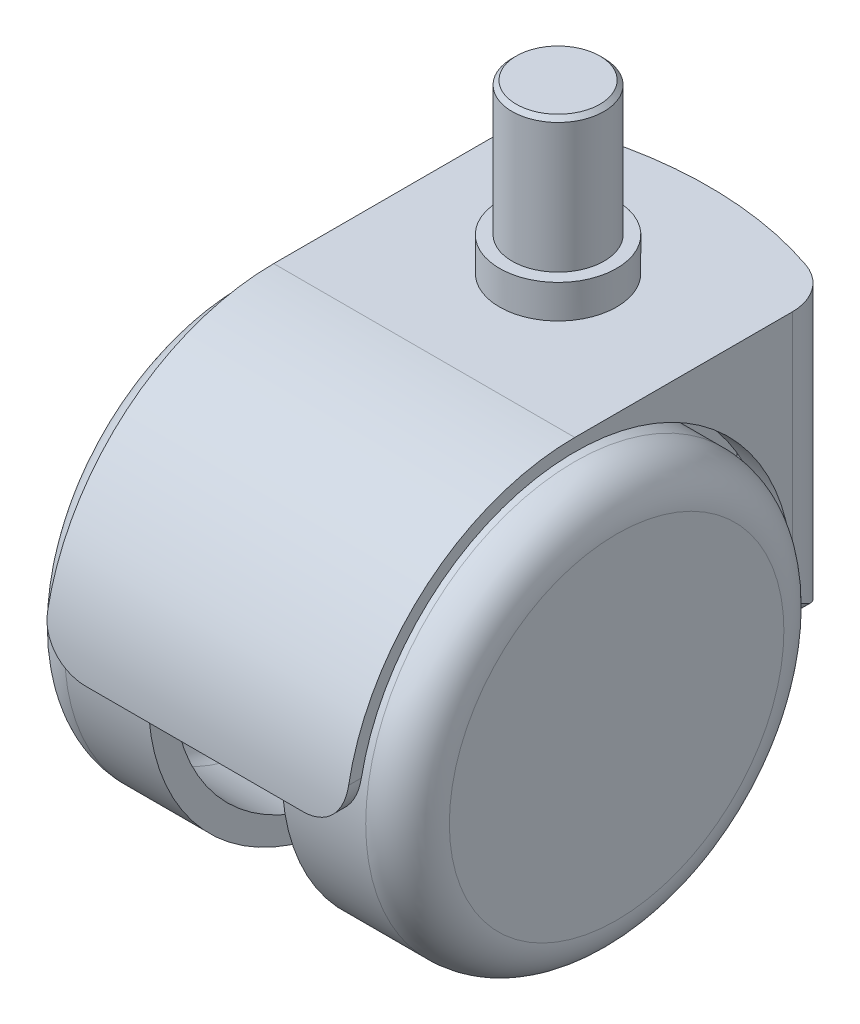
ISO-10303-21;
HEADER;
FILE_DESCRIPTION(('STEP AP214'),'2;1');
FILE_NAME('part.step','',(''),(''),'','','');
FILE_SCHEMA(('AUTOMOTIVE_DESIGN { 1 0 10303 214 1 1 1 1 }'));
ENDSEC;
DATA;
#1=APPLICATION_CONTEXT('core data for automotive mechanical design processes');
#2=APPLICATION_PROTOCOL_DEFINITION('international standard','automotive_design',2000,#1);
#3=PRODUCT_CONTEXT('',#1,'mechanical');
#4=PRODUCT('Part','Part','',(#3));
#5=PRODUCT_RELATED_PRODUCT_CATEGORY('part','',(#4));
#6=PRODUCT_DEFINITION_FORMATION('','',#4);
#7=PRODUCT_DEFINITION_CONTEXT('part definition',#1,'design');
#8=PRODUCT_DEFINITION('design','',#6,#7);
#9=PRODUCT_DEFINITION_SHAPE('','',#8);
#10=(LENGTH_UNIT() NAMED_UNIT(*) SI_UNIT(.MILLI.,.METRE.));
#11=(NAMED_UNIT(*) PLANE_ANGLE_UNIT() SI_UNIT($,.RADIAN.));
#12=(NAMED_UNIT(*) SI_UNIT($,.STERADIAN.) SOLID_ANGLE_UNIT());
#13=UNCERTAINTY_MEASURE_WITH_UNIT(LENGTH_MEASURE(1.E-05),#10,'distance_accuracy_value','');
#14=(GEOMETRIC_REPRESENTATION_CONTEXT(3) GLOBAL_UNCERTAINTY_ASSIGNED_CONTEXT((#13)) GLOBAL_UNIT_ASSIGNED_CONTEXT((#10,
#11,#12)) REPRESENTATION_CONTEXT('',''));
#15=CARTESIAN_POINT('',(0.,0.,0.));
#16=DIRECTION('',(0.,0.,1.));
#17=DIRECTION('',(1.,0.,0.));
#18=AXIS2_PLACEMENT_3D('',#15,#16,#17);
#19=CARTESIAN_POINT('',(-23.,0.,0.));
#20=DIRECTION('',(-1.,0.,0.));
#21=DIRECTION('',(0.,-1.,0.));
#22=AXIS2_PLACEMENT_3D('',#19,#20,#21);
#23=CYLINDRICAL_SURFACE('',#22,4.);
#24=CARTESIAN_POINT('',(-20.,0.,0.));
#25=DIRECTION('',(-1.,0.,0.));
#26=DIRECTION('',(0.,-1.,0.));
#27=AXIS2_PLACEMENT_3D('',#24,#25,#26);
#28=CIRCLE('',#27,4.);
#29=CARTESIAN_POINT('',(-20.,-4.,0.));
#30=VERTEX_POINT('',#29);
#31=EDGE_CURVE('E542',#30,#30,#28,.T.);
#32=ORIENTED_EDGE('',*,*,#31,.F.);
#33=EDGE_LOOP('',(#32));
#34=FACE_BOUND('',#33,.T.);
#35=CARTESIAN_POINT('',(-7.,0.,0.));
#36=DIRECTION('',(-1.,0.,0.));
#37=DIRECTION('',(0.,0.,1.));
#38=AXIS2_PLACEMENT_3D('',#35,#36,#37);
#39=CIRCLE('',#38,4.);
#40=CARTESIAN_POINT('',(-7.,0.,4.));
#41=VERTEX_POINT('',#40);
#42=EDGE_CURVE('E575',#41,#41,#39,.T.);
#43=ORIENTED_EDGE('',*,*,#42,.T.);
#44=EDGE_LOOP('',(#43));
#45=FACE_BOUND('',#44,.T.);
#46=ADVANCED_FACE('F48',(#34,#45),#23,.T.);
#47=CARTESIAN_POINT('',(7.,-7.,-30.3827373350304));
#48=DIRECTION('',(1.,0.,0.));
#49=DIRECTION('',(0.,0.,-1.));
#50=AXIS2_PLACEMENT_3D('',#47,#48,#49);
#51=PLANE('',#50);
#52=CARTESIAN_POINT('',(7.,0.,0.));
#53=DIRECTION('',(1.,0.,0.));
#54=DIRECTION('',(0.,0.,-1.));
#55=AXIS2_PLACEMENT_3D('',#52,#53,#54);
#56=CIRCLE('',#55,26.);
#57=CARTESIAN_POINT('',(7.,24.5,-8.70344759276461));
#58=VERTEX_POINT('',#57);
#59=CARTESIAN_POINT('',(7.,12.7561837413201,22.6556786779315));
#60=VERTEX_POINT('',#59);
#61=EDGE_CURVE('E64',#58,#60,#56,.T.);
#62=ORIENTED_EDGE('',*,*,#61,.T.);
#63=DIRECTION('',(0.,-0.707106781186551,-0.707106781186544));
#64=VECTOR('',#63,1.);
#65=CARTESIAN_POINT('',(7.,-4.94974746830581,4.94974746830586));
#66=LINE('',#65,#64);
#67=CARTESIAN_POINT('',(7.,-4.94974746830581,4.94974746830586));
#68=VERTEX_POINT('',#67);
#69=EDGE_CURVE('E210',#60,#68,#66,.T.);
#70=ORIENTED_EDGE('',*,*,#69,.T.);
#71=CARTESIAN_POINT('',(7.,0.,0.));
#72=DIRECTION('',(1.,0.,0.));
#73=DIRECTION('',(0.,0.,1.));
#74=AXIS2_PLACEMENT_3D('',#71,#72,#73);
#75=CIRCLE('',#74,7.);
#76=CARTESIAN_POINT('',(7.,-7.,0.));
#77=VERTEX_POINT('',#76);
#78=EDGE_CURVE('E216',#68,#77,#75,.T.);
#79=ORIENTED_EDGE('',*,*,#78,.T.);
#80=DIRECTION('',(0.,0.,-1.));
#81=VECTOR('',#80,1.);
#82=CARTESIAN_POINT('',(7.,-7.,-30.3827373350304));
#83=LINE('',#82,#81);
#84=CARTESIAN_POINT('',(7.,-7.,-30.3827373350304));
#85=VERTEX_POINT('',#84);
#86=EDGE_CURVE('E630',#77,#85,#83,.T.);
#87=ORIENTED_EDGE('',*,*,#86,.T.);
#88=DIRECTION('',(0.,1.,0.));
#89=VECTOR('',#88,1.);
#90=CARTESIAN_POINT('',(7.,-7.,-30.3827373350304));
#91=LINE('',#90,#89);
#92=CARTESIAN_POINT('',(7.,24.5,-30.3827373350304));
#93=VERTEX_POINT('',#92);
#94=EDGE_CURVE('E629',#85,#93,#91,.T.);
#95=ORIENTED_EDGE('',*,*,#94,.T.);
#96=DIRECTION('',(0.,0.,-1.));
#97=VECTOR('',#96,1.);
#98=CARTESIAN_POINT('',(7.,24.5,-30.3827373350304));
#99=LINE('',#98,#97);
#100=EDGE_CURVE('E784',#58,#93,#99,.T.);
#101=ORIENTED_EDGE('',*,*,#100,.F.);
#102=EDGE_LOOP('',(#62,#70,#79,#87,#95,#101));
#103=FACE_BOUND('',#102,.T.);
#104=CARTESIAN_POINT('',(7.,0.,0.));
#105=DIRECTION('',(1.,0.,0.));
#106=DIRECTION('',(0.,0.,-1.));
#107=AXIS2_PLACEMENT_3D('',#104,#105,#106);
#108=CIRCLE('',#107,4.);
#109=CARTESIAN_POINT('',(7.,0.,-4.));
#110=VERTEX_POINT('',#109);
#111=EDGE_CURVE('E536',#110,#110,#108,.T.);
#112=ORIENTED_EDGE('',*,*,#111,.F.);
#113=EDGE_LOOP('',(#112));
#114=FACE_BOUND('',#113,.T.);
#115=ADVANCED_FACE('F212',(#103,#114),#51,.T.);
#116=CARTESIAN_POINT('',(-7.,-7.,-30.3827373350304));
#117=DIRECTION('',(-1.,0.,0.));
#118=DIRECTION('',(0.,0.,1.));
#119=AXIS2_PLACEMENT_3D('',#116,#117,#118);
#120=PLANE('',#119);
#121=DIRECTION('',(0.,-0.707106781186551,-0.707106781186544));
#122=VECTOR('',#121,1.);
#123=CARTESIAN_POINT('',(-7.,-4.94974746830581,4.94974746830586));
#124=LINE('',#123,#122);
#125=CARTESIAN_POINT('',(-7.,12.7561837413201,22.6556786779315));
#126=VERTEX_POINT('',#125);
#127=CARTESIAN_POINT('',(-7.,-4.94974746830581,4.94974746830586));
#128=VERTEX_POINT('',#127);
#129=EDGE_CURVE('E226',#126,#128,#124,.T.);
#130=ORIENTED_EDGE('',*,*,#129,.F.);
#131=CARTESIAN_POINT('',(-7.,0.,0.));
#132=DIRECTION('',(-1.,0.,0.));
#133=DIRECTION('',(0.,0.,1.));
#134=AXIS2_PLACEMENT_3D('',#131,#132,#133);
#135=CIRCLE('',#134,26.);
#136=CARTESIAN_POINT('',(-7.,24.5,-8.70344759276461));
#137=VERTEX_POINT('',#136);
#138=EDGE_CURVE('E11',#126,#137,#135,.T.);
#139=ORIENTED_EDGE('',*,*,#138,.T.);
#140=DIRECTION('',(0.,0.,1.));
#141=VECTOR('',#140,1.);
#142=CARTESIAN_POINT('',(-7.,24.5,-30.3827373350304));
#143=LINE('',#142,#141);
#144=CARTESIAN_POINT('',(-7.,24.5,-30.3827373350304));
#145=VERTEX_POINT('',#144);
#146=EDGE_CURVE('E57',#145,#137,#143,.T.);
#147=ORIENTED_EDGE('',*,*,#146,.F.);
#148=DIRECTION('',(0.,1.,0.));
#149=VECTOR('',#148,1.);
#150=CARTESIAN_POINT('',(-7.,-7.,-30.3827373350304));
#151=LINE('',#150,#149);
#152=CARTESIAN_POINT('',(-7.,-7.,-30.3827373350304));
#153=VERTEX_POINT('',#152);
#154=EDGE_CURVE('E625',#153,#145,#151,.T.);
#155=ORIENTED_EDGE('',*,*,#154,.F.);
#156=DIRECTION('',(0.,0.,1.));
#157=VECTOR('',#156,1.);
#158=CARTESIAN_POINT('',(-7.,-7.,-30.3827373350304));
#159=LINE('',#158,#157);
#160=CARTESIAN_POINT('',(-7.,-7.,0.));
#161=VERTEX_POINT('',#160);
#162=EDGE_CURVE('E801',#153,#161,#159,.T.);
#163=ORIENTED_EDGE('',*,*,#162,.T.);
#164=CARTESIAN_POINT('',(-7.,0.,0.));
#165=DIRECTION('',(1.,0.,0.));
#166=DIRECTION('',(0.,0.,1.));
#167=AXIS2_PLACEMENT_3D('',#164,#165,#166);
#168=CIRCLE('',#167,7.);
#169=EDGE_CURVE('E221',#128,#161,#168,.T.);
#170=ORIENTED_EDGE('',*,*,#169,.F.);
#171=EDGE_LOOP('',(#130,#139,#147,#155,#163,#170));
#172=FACE_BOUND('',#171,.T.);
#173=ORIENTED_EDGE('',*,*,#42,.F.);
#174=EDGE_LOOP('',(#173));
#175=FACE_BOUND('',#174,.T.);
#176=ADVANCED_FACE('F515',(#172,#175),#120,.T.);
#177=CARTESIAN_POINT('',(23.,20.,0.));
#178=DIRECTION('',(-1.,0.,0.));
#179=DIRECTION('',(0.,-1.,0.));
#180=AXIS2_PLACEMENT_3D('',#177,#178,#179);
#181=PLANE('',#180);
#182=CARTESIAN_POINT('',(23.,0.,0.));
#183=DIRECTION('',(-1.,0.,0.));
#184=DIRECTION('',(0.,-1.,0.));
#185=AXIS2_PLACEMENT_3D('',#182,#183,#184);
#186=CIRCLE('',#185,20.);
#187=CARTESIAN_POINT('',(23.,-20.,0.));
#188=VERTEX_POINT('',#187);
#189=EDGE_CURVE('E571',#188,#188,#186,.T.);
#190=ORIENTED_EDGE('',*,*,#189,.F.);
#191=EDGE_LOOP('',(#190));
#192=FACE_BOUND('',#191,.T.);
#193=ADVANCED_FACE('F50',(#192),#181,.F.);
#194=CARTESIAN_POINT('',(18.,0.,0.));
#195=DIRECTION('',(-1.,0.,0.));
#196=DIRECTION('',(0.,-1.,0.));
#197=AXIS2_PLACEMENT_3D('',#194,#195,#196);
#198=TOROIDAL_SURFACE('',#197,20.,5.);
#199=CARTESIAN_POINT('',(18.,0.,0.));
#200=DIRECTION('',(-1.,0.,0.));
#201=DIRECTION('',(0.,-1.,0.));
#202=AXIS2_PLACEMENT_3D('',#199,#200,#201);
#203=CIRCLE('',#202,25.);
#204=CARTESIAN_POINT('',(18.,-25.,0.));
#205=VERTEX_POINT('',#204);
#206=EDGE_CURVE('E567',#205,#205,#203,.T.);
#207=ORIENTED_EDGE('',*,*,#206,.F.);
#208=EDGE_LOOP('',(#207));
#209=FACE_BOUND('',#208,.T.);
#210=ORIENTED_EDGE('',*,*,#189,.T.);
#211=EDGE_LOOP('',(#210));
#212=FACE_BOUND('',#211,.T.);
#213=ADVANCED_FACE('F1139',(#209,#212),#198,.T.);
#214=CARTESIAN_POINT('',(-23.,0.,0.));
#215=DIRECTION('',(-1.,0.,0.));
#216=DIRECTION('',(0.,-1.,0.));
#217=AXIS2_PLACEMENT_3D('',#214,#215,#216);
#218=CYLINDRICAL_SURFACE('',#217,25.);
#219=CARTESIAN_POINT('',(7.99999999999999,0.,0.));
#220=DIRECTION('',(-1.,0.,0.));
#221=DIRECTION('',(0.,-1.,0.));
#222=AXIS2_PLACEMENT_3D('',#219,#220,#221);
#223=CIRCLE('',#222,25.);
#224=CARTESIAN_POINT('',(8.,-25.,0.));
#225=VERTEX_POINT('',#224);
#226=EDGE_CURVE('E563',#225,#225,#223,.T.);
#227=ORIENTED_EDGE('',*,*,#226,.F.);
#228=EDGE_LOOP('',(#227));
#229=FACE_BOUND('',#228,.T.);
#230=ORIENTED_EDGE('',*,*,#206,.T.);
#231=EDGE_LOOP('',(#230));
#232=FACE_BOUND('',#231,.T.);
#233=ADVANCED_FACE('F1130',(#229,#232),#218,.T.);
#234=CARTESIAN_POINT('',(7.99999999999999,25.,0.));
#235=DIRECTION('',(1.,0.,0.));
#236=DIRECTION('',(0.,1.,0.));
#237=AXIS2_PLACEMENT_3D('',#234,#235,#236);
#238=PLANE('',#237);
#239=CARTESIAN_POINT('',(7.99999999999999,0.,0.));
#240=DIRECTION('',(-1.,0.,0.));
#241=DIRECTION('',(0.,-1.,0.));
#242=AXIS2_PLACEMENT_3D('',#239,#240,#241);
#243=CIRCLE('',#242,22.);
#244=CARTESIAN_POINT('',(8.,-22.,0.));
#245=VERTEX_POINT('',#244);
#246=EDGE_CURVE('E559',#245,#245,#243,.T.);
#247=ORIENTED_EDGE('',*,*,#246,.F.);
#248=EDGE_LOOP('',(#247));
#249=FACE_BOUND('',#248,.T.);
#250=ORIENTED_EDGE('',*,*,#226,.T.);
#251=EDGE_LOOP('',(#250));
#252=FACE_BOUND('',#251,.T.);
#253=ADVANCED_FACE('F1121',(#249,#252),#238,.F.);
#254=CARTESIAN_POINT('',(-23.,0.,0.));
#255=DIRECTION('',(-1.,0.,0.));
#256=DIRECTION('',(0.,-1.,0.));
#257=AXIS2_PLACEMENT_3D('',#254,#255,#256);
#258=CYLINDRICAL_SURFACE('',#257,22.);
#259=CARTESIAN_POINT('',(18.,0.,0.));
#260=DIRECTION('',(-1.,0.,0.));
#261=DIRECTION('',(0.,-1.,0.));
#262=AXIS2_PLACEMENT_3D('',#259,#260,#261);
#263=CIRCLE('',#262,22.);
#264=CARTESIAN_POINT('',(18.,-22.,0.));
#265=VERTEX_POINT('',#264);
#266=EDGE_CURVE('E549',#265,#265,#263,.T.);
#267=ORIENTED_EDGE('',*,*,#266,.F.);
#268=EDGE_LOOP('',(#267));
#269=FACE_BOUND('',#268,.T.);
#270=ORIENTED_EDGE('',*,*,#246,.T.);
#271=EDGE_LOOP('',(#270));
#272=FACE_BOUND('',#271,.T.);
#273=ADVANCED_FACE('F1112',(#269,#272),#258,.F.);
#274=CARTESIAN_POINT('',(18.,0.,0.));
#275=DIRECTION('',(-1.,0.,0.));
#276=DIRECTION('',(0.,-1.,0.));
#277=AXIS2_PLACEMENT_3D('',#274,#275,#276);
#278=TOROIDAL_SURFACE('',#277,20.,2.);
#279=CARTESIAN_POINT('',(20.,0.,0.));
#280=DIRECTION('',(-1.,0.,0.));
#281=DIRECTION('',(0.,-1.,0.));
#282=AXIS2_PLACEMENT_3D('',#279,#280,#281);
#283=CIRCLE('',#282,20.);
#284=CARTESIAN_POINT('',(20.,-20.,0.));
#285=VERTEX_POINT('',#284);
#286=EDGE_CURVE('E541',#285,#285,#283,.T.);
#287=ORIENTED_EDGE('',*,*,#286,.F.);
#288=EDGE_LOOP('',(#287));
#289=FACE_BOUND('',#288,.T.);
#290=ORIENTED_EDGE('',*,*,#266,.T.);
#291=EDGE_LOOP('',(#290));
#292=FACE_BOUND('',#291,.T.);
#293=ADVANCED_FACE('F531',(#289,#292),#278,.F.);
#294=CARTESIAN_POINT('',(20.,20.,0.));
#295=DIRECTION('',(1.,0.,0.));
#296=DIRECTION('',(0.,1.,0.));
#297=AXIS2_PLACEMENT_3D('',#294,#295,#296);
#298=PLANE('',#297);
#299=CARTESIAN_POINT('',(20.,0.,0.));
#300=DIRECTION('',(-1.,0.,0.));
#301=DIRECTION('',(0.,-1.,0.));
#302=AXIS2_PLACEMENT_3D('',#299,#300,#301);
#303=CIRCLE('',#302,4.);
#304=CARTESIAN_POINT('',(20.,-3.99999999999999,0.));
#305=VERTEX_POINT('',#304);
#306=EDGE_CURVE('E539',#305,#305,#303,.T.);
#307=ORIENTED_EDGE('',*,*,#306,.F.);
#308=EDGE_LOOP('',(#307));
#309=FACE_BOUND('',#308,.T.);
#310=ORIENTED_EDGE('',*,*,#286,.T.);
#311=EDGE_LOOP('',(#310));
#312=FACE_BOUND('',#311,.T.);
#313=ADVANCED_FACE('F523',(#309,#312),#298,.F.);
#314=ORIENTED_EDGE('',*,*,#111,.T.);
#315=EDGE_LOOP('',(#314));
#316=FACE_BOUND('',#315,.T.);
#317=ORIENTED_EDGE('',*,*,#306,.T.);
#318=EDGE_LOOP('',(#317));
#319=FACE_BOUND('',#318,.T.);
#320=ADVANCED_FACE('F511',(#316,#319),#23,.T.);
#321=CARTESIAN_POINT('',(-20.,20.,0.));
#322=DIRECTION('',(-1.,0.,0.));
#323=DIRECTION('',(0.,-1.,0.));
#324=AXIS2_PLACEMENT_3D('',#321,#322,#323);
#325=PLANE('',#324);
#326=CARTESIAN_POINT('',(-20.,0.,0.));
#327=DIRECTION('',(-1.,0.,0.));
#328=DIRECTION('',(0.,-1.,0.));
#329=AXIS2_PLACEMENT_3D('',#326,#327,#328);
#330=CIRCLE('',#329,20.);
#331=CARTESIAN_POINT('',(-20.,-20.,0.));
#332=VERTEX_POINT('',#331);
#333=EDGE_CURVE('E552',#332,#332,#330,.T.);
#334=ORIENTED_EDGE('',*,*,#333,.F.);
#335=EDGE_LOOP('',(#334));
#336=FACE_BOUND('',#335,.T.);
#337=ORIENTED_EDGE('',*,*,#31,.T.);
#338=EDGE_LOOP('',(#337));
#339=FACE_BOUND('',#338,.T.);
#340=ADVANCED_FACE('F522',(#336,#339),#325,.F.);
#341=CARTESIAN_POINT('',(-18.,0.,0.));
#342=DIRECTION('',(-1.,0.,0.));
#343=DIRECTION('',(0.,-1.,0.));
#344=AXIS2_PLACEMENT_3D('',#341,#342,#343);
#345=TOROIDAL_SURFACE('',#344,20.,2.);
#346=CARTESIAN_POINT('',(-18.,0.,0.));
#347=DIRECTION('',(-1.,0.,0.));
#348=DIRECTION('',(0.,-1.,0.));
#349=AXIS2_PLACEMENT_3D('',#346,#347,#348);
#350=CIRCLE('',#349,22.);
#351=CARTESIAN_POINT('',(-18.,-22.,0.));
#352=VERTEX_POINT('',#351);
#353=EDGE_CURVE('E656',#352,#352,#350,.T.);
#354=ORIENTED_EDGE('',*,*,#353,.F.);
#355=EDGE_LOOP('',(#354));
#356=FACE_BOUND('',#355,.T.);
#357=ORIENTED_EDGE('',*,*,#333,.T.);
#358=EDGE_LOOP('',(#357));
#359=FACE_BOUND('',#358,.T.);
#360=ADVANCED_FACE('F529',(#356,#359),#345,.F.);
#361=CARTESIAN_POINT('',(-23.,0.,0.));
#362=DIRECTION('',(-1.,0.,0.));
#363=DIRECTION('',(0.,-1.,0.));
#364=AXIS2_PLACEMENT_3D('',#361,#362,#363);
#365=CYLINDRICAL_SURFACE('',#364,22.);
#366=CARTESIAN_POINT('',(-8.,0.,0.));
#367=DIRECTION('',(-1.,0.,0.));
#368=DIRECTION('',(0.,-1.,0.));
#369=AXIS2_PLACEMENT_3D('',#366,#367,#368);
#370=CIRCLE('',#369,22.);
#371=CARTESIAN_POINT('',(-7.99999999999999,-22.,0.));
#372=VERTEX_POINT('',#371);
#373=EDGE_CURVE('E652',#372,#372,#370,.T.);
#374=ORIENTED_EDGE('',*,*,#373,.F.);
#375=EDGE_LOOP('',(#374));
#376=FACE_BOUND('',#375,.T.);
#377=ORIENTED_EDGE('',*,*,#353,.T.);
#378=EDGE_LOOP('',(#377));
#379=FACE_BOUND('',#378,.T.);
#380=ADVANCED_FACE('F667',(#376,#379),#365,.F.);
#381=CARTESIAN_POINT('',(-8.,25.,0.));
#382=DIRECTION('',(-1.,0.,0.));
#383=DIRECTION('',(0.,-1.,0.));
#384=AXIS2_PLACEMENT_3D('',#381,#382,#383);
#385=PLANE('',#384);
#386=CARTESIAN_POINT('',(-8.,0.,0.));
#387=DIRECTION('',(-1.,0.,0.));
#388=DIRECTION('',(0.,-1.,0.));
#389=AXIS2_PLACEMENT_3D('',#386,#387,#388);
#390=CIRCLE('',#389,25.);
#391=CARTESIAN_POINT('',(-7.99999999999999,-25.,0.));
#392=VERTEX_POINT('',#391);
#393=EDGE_CURVE('E648',#392,#392,#390,.T.);
#394=ORIENTED_EDGE('',*,*,#393,.F.);
#395=EDGE_LOOP('',(#394));
#396=FACE_BOUND('',#395,.T.);
#397=ORIENTED_EDGE('',*,*,#373,.T.);
#398=EDGE_LOOP('',(#397));
#399=FACE_BOUND('',#398,.T.);
#400=ADVANCED_FACE('F673',(#396,#399),#385,.F.);
#401=CARTESIAN_POINT('',(-23.,0.,0.));
#402=DIRECTION('',(-1.,0.,0.));
#403=DIRECTION('',(0.,-1.,0.));
#404=AXIS2_PLACEMENT_3D('',#401,#402,#403);
#405=CYLINDRICAL_SURFACE('',#404,25.);
#406=CARTESIAN_POINT('',(-18.,0.,0.));
#407=DIRECTION('',(-1.,0.,0.));
#408=DIRECTION('',(0.,-1.,0.));
#409=AXIS2_PLACEMENT_3D('',#406,#407,#408);
#410=CIRCLE('',#409,25.);
#411=CARTESIAN_POINT('',(-18.,-25.,0.));
#412=VERTEX_POINT('',#411);
#413=EDGE_CURVE('E644',#412,#412,#410,.T.);
#414=ORIENTED_EDGE('',*,*,#413,.F.);
#415=EDGE_LOOP('',(#414));
#416=FACE_BOUND('',#415,.T.);
#417=ORIENTED_EDGE('',*,*,#393,.T.);
#418=EDGE_LOOP('',(#417));
#419=FACE_BOUND('',#418,.T.);
#420=ADVANCED_FACE('F680',(#416,#419),#405,.T.);
#421=CARTESIAN_POINT('',(-18.,0.,0.));
#422=DIRECTION('',(-1.,0.,0.));
#423=DIRECTION('',(0.,-1.,0.));
#424=AXIS2_PLACEMENT_3D('',#421,#422,#423);
#425=TOROIDAL_SURFACE('',#424,20.,5.);
#426=CARTESIAN_POINT('',(-23.,0.,0.));
#427=DIRECTION('',(-1.,0.,0.));
#428=DIRECTION('',(0.,-1.,0.));
#429=AXIS2_PLACEMENT_3D('',#426,#427,#428);
#430=CIRCLE('',#429,20.);
#431=CARTESIAN_POINT('',(-23.,-20.,0.));
#432=VERTEX_POINT('',#431);
#433=EDGE_CURVE('E636',#432,#432,#430,.T.);
#434=ORIENTED_EDGE('',*,*,#433,.F.);
#435=EDGE_LOOP('',(#434));
#436=FACE_BOUND('',#435,.T.);
#437=ORIENTED_EDGE('',*,*,#413,.T.);
#438=EDGE_LOOP('',(#437));
#439=FACE_BOUND('',#438,.T.);
#440=ADVANCED_FACE('F684',(#436,#439),#425,.T.);
#441=CARTESIAN_POINT('',(-23.,20.,0.));
#442=DIRECTION('',(1.,0.,0.));
#443=DIRECTION('',(0.,1.,0.));
#444=AXIS2_PLACEMENT_3D('',#441,#442,#443);
#445=PLANE('',#444);
#446=ORIENTED_EDGE('',*,*,#433,.T.);
#447=EDGE_LOOP('',(#446));
#448=FACE_BOUND('',#447,.T.);
#449=ADVANCED_FACE('F688',(#448),#445,.F.);
#450=CARTESIAN_POINT('',(0.,-7.,8.99999999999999));
#451=DIRECTION('',(0.,1.,0.));
#452=DIRECTION('',(0.,0.,1.));
#453=AXIS2_PLACEMENT_3D('',#450,#451,#452);
#454=PLANE('',#453);
#455=CARTESIAN_POINT('',(0.,-7.,8.99999999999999));
#456=DIRECTION('',(0.,1.,0.));
#457=DIRECTION('',(0.,0.,1.));
#458=AXIS2_PLACEMENT_3D('',#455,#456,#457);
#459=CIRCLE('',#458,40.);
#460=EDGE_CURVE('E626',#85,#153,#459,.T.);
#461=ORIENTED_EDGE('',*,*,#460,.F.);
#462=ORIENTED_EDGE('',*,*,#86,.F.);
#463=DIRECTION('',(1.,0.,0.));
#464=VECTOR('',#463,1.);
#465=CARTESIAN_POINT('',(-7.,-7.,0.));
#466=LINE('',#465,#464);
#467=EDGE_CURVE('E234',#161,#77,#466,.T.);
#468=ORIENTED_EDGE('',*,*,#467,.F.);
#469=ORIENTED_EDGE('',*,*,#162,.F.);
#470=EDGE_LOOP('',(#461,#462,#468,#469));
#471=FACE_BOUND('',#470,.T.);
#472=ADVANCED_FACE('F692',(#471),#454,.F.);
#473=CARTESIAN_POINT('',(18.,24.5,0.));
#474=DIRECTION('',(0.,-1.,0.));
#475=DIRECTION('',(0.,0.,-1.));
#476=AXIS2_PLACEMENT_3D('',#473,#474,#475);
#477=PLANE('',#476);
#478=DIRECTION('',(-1.,0.,0.));
#479=VECTOR('',#478,1.);
#480=CARTESIAN_POINT('',(18.,24.5,-8.70344759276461));
#481=LINE('',#480,#479);
#482=CARTESIAN_POINT('',(15.,24.5,-8.70344759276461));
#483=VERTEX_POINT('',#482);
#484=EDGE_CURVE('E335',#483,#58,#481,.T.);
#485=ORIENTED_EDGE('',*,*,#484,.T.);
#486=ORIENTED_EDGE('',*,*,#100,.T.);
#487=CARTESIAN_POINT('',(0.,24.5,8.99999999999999));
#488=DIRECTION('',(0.,-1.,0.));
#489=DIRECTION('',(0.,0.,-1.));
#490=AXIS2_PLACEMENT_3D('',#487,#488,#489);
#491=CIRCLE('',#490,40.);
#492=CARTESIAN_POINT('',(12.972972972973,24.5,-28.8378378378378));
#493=VERTEX_POINT('',#492);
#494=EDGE_CURVE('E273',#93,#493,#491,.T.);
#495=ORIENTED_EDGE('',*,*,#494,.T.);
#496=CARTESIAN_POINT('',(12.,24.5,-26.));
#497=DIRECTION('',(0.,-1.,0.));
#498=DIRECTION('',(0.,0.,-1.));
#499=AXIS2_PLACEMENT_3D('',#496,#497,#498);
#500=CIRCLE('',#499,3.);
#501=CARTESIAN_POINT('',(15.,24.5,-26.));
#502=VERTEX_POINT('',#501);
#503=EDGE_CURVE('E263',#493,#502,#500,.T.);
#504=ORIENTED_EDGE('',*,*,#503,.T.);
#505=DIRECTION('',(0.,0.,1.));
#506=VECTOR('',#505,1.);
#507=CARTESIAN_POINT('',(15.,24.5,0.));
#508=LINE('',#507,#506);
#509=EDGE_CURVE('E286',#502,#483,#508,.T.);
#510=ORIENTED_EDGE('',*,*,#509,.T.);
#511=EDGE_LOOP('',(#485,#486,#495,#504,#510));
#512=FACE_BOUND('',#511,.T.);
#513=ADVANCED_FACE('F349',(#512),#477,.T.);
#514=CARTESIAN_POINT('',(18.,0.,-26.));
#515=DIRECTION('',(0.,0.,-1.));
#516=DIRECTION('',(-1.,0.,0.));
#517=AXIS2_PLACEMENT_3D('',#514,#515,#516);
#518=PLANE('',#517);
#519=DIRECTION('',(0.,-1.,0.));
#520=VECTOR('',#519,1.);
#521=CARTESIAN_POINT('',(-15.,27.5,-26.));
#522=LINE('',#521,#520);
#523=CARTESIAN_POINT('',(-15.,0.,-26.));
#524=VERTEX_POINT('',#523);
#525=CARTESIAN_POINT('',(-15.0035004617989,-5.57956764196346,-26.));
#526=VERTEX_POINT('',#525);
#527=EDGE_CURVE('E613',#524,#526,#522,.T.);
#528=ORIENTED_EDGE('',*,*,#527,.F.);
#529=DIRECTION('',(-1.,0.,0.));
#530=VECTOR('',#529,1.);
#531=CARTESIAN_POINT('',(18.,0.,-26.));
#532=LINE('',#531,#530);
#533=CARTESIAN_POINT('',(-18.,0.,-26.));
#534=VERTEX_POINT('',#533);
#535=EDGE_CURVE('E480',#524,#534,#532,.T.);
#536=ORIENTED_EDGE('',*,*,#535,.T.);
#537=DIRECTION('',(0.,-1.,0.));
#538=VECTOR('',#537,1.);
#539=CARTESIAN_POINT('',(-18.,0.,-26.));
#540=LINE('',#539,#538);
#541=CARTESIAN_POINT('',(-18.,-2.5,-26.));
#542=VERTEX_POINT('',#541);
#543=EDGE_CURVE('E462',#534,#542,#540,.T.);
#544=ORIENTED_EDGE('',*,*,#543,.T.);
#545=CARTESIAN_POINT('',(-15.,-2.5,-26.));
#546=DIRECTION('',(0.,0.,-1.));
#547=DIRECTION('',(-1.,0.,0.));
#548=AXIS2_PLACEMENT_3D('',#545,#546,#547);
#549=CIRCLE('',#548,3.);
#550=CARTESIAN_POINT('',(-15.7860262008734,-5.39519650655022,-26.));
#551=VERTEX_POINT('',#550);
#552=EDGE_CURVE('E412',#542,#551,#549,.F.);
#553=ORIENTED_EDGE('',*,*,#552,.T.);
#554=CARTESIAN_POINT('',(0.,52.75,-26.));
#555=DIRECTION('',(0.,0.,-1.));
#556=DIRECTION('',(-1.,0.,0.));
#557=AXIS2_PLACEMENT_3D('',#554,#555,#556);
#558=CIRCLE('',#557,60.25);
#559=EDGE_CURVE('E416',#551,#526,#558,.F.);
#560=ORIENTED_EDGE('',*,*,#559,.T.);
#561=EDGE_LOOP('',(#528,#536,#544,#553,#560));
#562=FACE_BOUND('',#561,.T.);
#563=ADVANCED_FACE('F741',(#562),#518,.F.);
#564=DIRECTION('',(0.,-1.,0.));
#565=VECTOR('',#564,1.);
#566=CARTESIAN_POINT('',(15.,27.5,-26.));
#567=LINE('',#566,#565);
#568=CARTESIAN_POINT('',(15.0035004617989,-5.57956764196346,-26.));
#569=VERTEX_POINT('',#568);
#570=CARTESIAN_POINT('',(15.,0.,-26.));
#571=VERTEX_POINT('',#570);
#572=EDGE_CURVE('E602',#569,#571,#567,.F.);
#573=ORIENTED_EDGE('',*,*,#572,.F.);
#574=CARTESIAN_POINT('',(15.7860262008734,-5.39519650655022,-26.));
#575=VERTEX_POINT('',#574);
#576=EDGE_CURVE('E408',#569,#575,#558,.F.);
#577=ORIENTED_EDGE('',*,*,#576,.T.);
#578=CARTESIAN_POINT('',(15.,-2.5,-26.));
#579=DIRECTION('',(0.,0.,-1.));
#580=DIRECTION('',(-1.,0.,0.));
#581=AXIS2_PLACEMENT_3D('',#578,#579,#580);
#582=CIRCLE('',#581,3.);
#583=CARTESIAN_POINT('',(18.,-2.5,-26.));
#584=VERTEX_POINT('',#583);
#585=EDGE_CURVE('E415',#575,#584,#582,.F.);
#586=ORIENTED_EDGE('',*,*,#585,.T.);
#587=DIRECTION('',(0.,-1.,0.));
#588=VECTOR('',#587,1.);
#589=CARTESIAN_POINT('',(18.,0.,-26.));
#590=LINE('',#589,#588);
#591=CARTESIAN_POINT('',(18.,0.,-26.));
#592=VERTEX_POINT('',#591);
#593=EDGE_CURVE('E445',#592,#584,#590,.T.);
#594=ORIENTED_EDGE('',*,*,#593,.F.);
#595=EDGE_CURVE('E481',#592,#571,#532,.T.);
#596=ORIENTED_EDGE('',*,*,#595,.T.);
#597=EDGE_LOOP('',(#573,#577,#586,#594,#596));
#598=FACE_BOUND('',#597,.T.);
#599=ADVANCED_FACE('F744',(#598),#518,.F.);
#600=CARTESIAN_POINT('',(0.,52.75,0.));
#601=DIRECTION('',(0.,0.,-1.));
#602=DIRECTION('',(-1.,0.,0.));
#603=AXIS2_PLACEMENT_3D('',#600,#601,#602);
#604=CYLINDRICAL_SURFACE('',#603,60.25);
#605=CARTESIAN_POINT('',(-13.4852513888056,-5.97146536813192,-28.6065356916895));
#606=CARTESIAN_POINT('',(-13.3356320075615,-6.00582422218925,-28.691783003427));
#607=CARTESIAN_POINT('',(-13.1787221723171,-6.04125134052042,-28.7640851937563));
#608=CARTESIAN_POINT('',(-12.8548529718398,-6.11291545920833,-28.8807861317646));
#609=CARTESIAN_POINT('',(-12.687880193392,-6.1491534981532,-28.9251466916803));
#610=CARTESIAN_POINT('',(-12.3487805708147,-6.2211804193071,-28.9846193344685));
#611=CARTESIAN_POINT('',(-12.176656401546,-6.25696952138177,-28.9997463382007));
#612=CARTESIAN_POINT('',(-11.8321056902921,-6.32702322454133,-29.0002472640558));
#613=CARTESIAN_POINT('',(-11.659679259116,-6.36128829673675,-28.9856304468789));
#614=CARTESIAN_POINT('',(-11.319771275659,-6.4273200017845,-28.926939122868));
#615=CARTESIAN_POINT('',(-11.152280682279,-6.45909140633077,-28.8829224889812));
#616=CARTESIAN_POINT('',(-10.8268468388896,-6.51946341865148,-28.7665088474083));
#617=CARTESIAN_POINT('',(-10.6689034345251,-6.54806407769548,-28.6941122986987));
#618=CARTESIAN_POINT('',(-10.3695274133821,-6.60114338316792,-28.5240400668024));
#619=CARTESIAN_POINT('',(-10.2278930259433,-6.62567456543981,-28.4267360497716));
#620=CARTESIAN_POINT('',(-9.96292993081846,-6.6707086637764,-28.2090131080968));
#621=CARTESIAN_POINT('',(-9.83959951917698,-6.6912119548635,-28.0885963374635));
#622=CARTESIAN_POINT('',(-9.61692878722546,-6.72764066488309,-27.8301882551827));
#623=CARTESIAN_POINT('',(-9.5172304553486,-6.74363520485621,-27.6925151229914));
#624=CARTESIAN_POINT('',(-9.34234619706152,-6.77134859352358,-27.4020038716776));
#625=CARTESIAN_POINT('',(-9.26715852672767,-6.78306774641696,-27.2491668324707));
#626=CARTESIAN_POINT('',(-9.14438066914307,-6.80204981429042,-26.9346623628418));
#627=CARTESIAN_POINT('',(-9.09646840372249,-6.80936479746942,-26.7731237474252));
#628=CARTESIAN_POINT('',(-9.02831481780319,-6.81973422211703,-26.4441797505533));
#629=CARTESIAN_POINT('',(-9.00807239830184,-6.82278883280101,-26.2767746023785));
#630=CARTESIAN_POINT('',(-8.99591587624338,-6.82462576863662,-25.9419591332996));
#631=CARTESIAN_POINT('',(-9.00382695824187,-6.82343445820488,-25.7745552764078));
#632=CARTESIAN_POINT('',(-9.0473476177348,-6.81684041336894,-25.443475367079));
#633=CARTESIAN_POINT('',(-9.0829567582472,-6.81143774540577,-25.2797992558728));
#634=CARTESIAN_POINT('',(-9.18075638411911,-6.79644101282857,-24.9609358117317));
#635=CARTESIAN_POINT('',(-9.24292643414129,-6.78685017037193,-24.8057420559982));
#636=CARTESIAN_POINT('',(-9.39197217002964,-6.76351964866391,-24.5080548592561));
#637=CARTESIAN_POINT('',(-9.4788480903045,-6.74977993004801,-24.3655615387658));
#638=CARTESIAN_POINT('',(-9.67515531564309,-6.71817438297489,-24.0965976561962));
#639=CARTESIAN_POINT('',(-9.78468599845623,-6.70029033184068,-23.9702017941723));
#640=CARTESIAN_POINT('',(-10.022811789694,-6.66060749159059,-23.737604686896));
#641=CARTESIAN_POINT('',(-10.1514076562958,-6.63880854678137,-23.6314042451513));
#642=CARTESIAN_POINT('',(-10.4253087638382,-6.59134239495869,-23.4410068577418));
#643=CARTESIAN_POINT('',(-10.5707701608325,-6.56563821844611,-23.3570438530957));
#644=CARTESIAN_POINT('',(-10.8731260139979,-6.51095861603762,-23.214666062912));
#645=CARTESIAN_POINT('',(-11.0300213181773,-6.48198294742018,-23.1562531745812));
#646=CARTESIAN_POINT('',(-11.3532713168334,-6.42088110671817,-23.0656620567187));
#647=CARTESIAN_POINT('',(-11.5197332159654,-6.38871390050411,-23.0338941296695));
#648=CARTESIAN_POINT('',(-11.8552339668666,-6.32237233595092,-22.9987501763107));
#649=CARTESIAN_POINT('',(-12.0242730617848,-6.28819778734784,-22.9953768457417));
#650=CARTESIAN_POINT('',(-12.3629723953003,-6.21820994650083,-23.0171321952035));
#651=CARTESIAN_POINT('',(-12.5326000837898,-6.1823792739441,-23.0427130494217));
#652=CARTESIAN_POINT('',(-12.8650423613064,-6.1107009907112,-23.1223408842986));
#653=CARTESIAN_POINT('',(-13.0278564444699,-6.0748533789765,-23.1763899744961));
#654=CARTESIAN_POINT('',(-13.3433777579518,-6.00409035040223,-23.3120539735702));
#655=CARTESIAN_POINT('',(-13.4959957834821,-5.96918444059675,-23.3938815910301));
#656=CARTESIAN_POINT('',(-13.785301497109,-5.90193985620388,-23.5828636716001));
#657=CARTESIAN_POINT('',(-13.9219894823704,-5.86960113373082,-23.6900176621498));
#658=CARTESIAN_POINT('',(-14.1741801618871,-5.80913094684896,-23.9257610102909));
#659=CARTESIAN_POINT('',(-14.2898607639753,-5.78096456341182,-24.0541508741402));
#660=CARTESIAN_POINT('',(-14.4978656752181,-5.72979052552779,-24.3295422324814));
#661=CARTESIAN_POINT('',(-14.5901933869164,-5.70678211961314,-24.4765410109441));
#662=CARTESIAN_POINT('',(-14.7463853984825,-5.66757412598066,-24.7810246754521));
#663=CARTESIAN_POINT('',(-14.8109113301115,-5.65121685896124,-24.9381497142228));
#664=CARTESIAN_POINT('',(-14.9126270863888,-5.62532729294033,-25.2615425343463));
#665=CARTESIAN_POINT('',(-14.9498218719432,-5.6157937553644,-25.4278086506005));
#666=CARTESIAN_POINT('',(-14.9949346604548,-5.60421976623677,-25.7598545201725));
#667=CARTESIAN_POINT('',(-15.0036283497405,-5.60198079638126,-25.92552232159));
#668=CARTESIAN_POINT('',(-14.9936264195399,-5.60455161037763,-26.2559583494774));
#669=CARTESIAN_POINT('',(-14.9749342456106,-5.60936050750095,-26.4207266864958));
#670=CARTESIAN_POINT('',(-14.911162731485,-5.62568653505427,-26.7428305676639));
#671=CARTESIAN_POINT('',(-14.8663745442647,-5.63712964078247,-26.9002277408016));
#672=CARTESIAN_POINT('',(-14.7520858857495,-5.66611004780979,-27.2052181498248));
#673=CARTESIAN_POINT('',(-14.6825781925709,-5.6836491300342,-27.3528085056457));
#674=CARTESIAN_POINT('',(-14.519933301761,-5.72427756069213,-27.6361510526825));
#675=CARTESIAN_POINT('',(-14.4264910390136,-5.74743834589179,-27.7717174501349));
#676=CARTESIAN_POINT('',(-14.2193051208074,-5.79814406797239,-28.0251994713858));
#677=CARTESIAN_POINT('',(-14.1055823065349,-5.82568450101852,-28.1431329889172));
#678=CARTESIAN_POINT('',(-13.9065302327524,-5.87317945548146,-28.3185462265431));
#679=CARTESIAN_POINT('',(-13.826328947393,-5.89215557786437,-28.3822174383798));
#680=CARTESIAN_POINT('',(-13.6600223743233,-5.93111786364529,-28.5009530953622));
#681=CARTESIAN_POINT('',(-13.5739170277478,-5.95110403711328,-28.5560174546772));
#682=CARTESIAN_POINT('',(-13.4852513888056,-5.97146536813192,-28.6065356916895));
#683=B_SPLINE_CURVE_WITH_KNOTS('',3,(#605,#606,#607,#608,#609,#610,#611,#612,#613,#614,#615,
#616,#617,#618,#619,#620,#621,#622,#623,#624,#625,#626,#627,#628,#629,#630,#631,#632,#633,#634,
#635,#636,#637,#638,#639,#640,#641,#642,#643,#644,#645,#646,#647,#648,#649,#650,#651,#652,#653,
#654,#655,#656,#657,#658,#659,#660,#661,#662,#663,#664,#665,#666,#667,#668,#669,#670,#671,#672,
#673,#674,#675,#676,#677,#678,#679,#680,#681,#682),.UNSPECIFIED.,.T.,.F.,(4,2,2,2,2,2,2,2,2,2,2,
2,2,2,2,2,2,2,2,2,2,2,2,2,2,2,2,2,2,2,2,2,2,2,2,2,2,2,4),(0.,0.526403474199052,1.05352483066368,
1.58037707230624,2.1070653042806,2.63271980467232,3.15836580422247,3.67658408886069,
4.19475410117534,4.70448466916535,5.21417896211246,5.71772262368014,6.22124628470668,
6.72164885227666,7.22204352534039,7.72205389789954,8.22206901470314,8.72432588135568,
9.2266027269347,9.73397070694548,10.2413763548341,10.7564590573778,11.2715906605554,
11.7948793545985,12.3182068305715,12.8456355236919,13.3730543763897,13.8957739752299,
14.4184173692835,14.9278245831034,15.437139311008,15.9324721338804,16.4277426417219,
16.9175904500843,17.4075814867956,17.9041589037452,18.4002289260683,18.7121767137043,
19.0241276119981),.UNSPECIFIED.);
#684=CARTESIAN_POINT('',(-12.972972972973,-6.0867612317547,-28.8378378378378));
#685=VERTEX_POINT('',#684);
#686=EDGE_CURVE('E272',#526,#685,#683,.T.);
#687=ORIENTED_EDGE('',*,*,#686,.F.);
#688=ORIENTED_EDGE('',*,*,#559,.F.);
#689=DIRECTION('',(0.,0.,-1.));
#690=VECTOR('',#689,1.);
#691=CARTESIAN_POINT('',(-15.7860262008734,-5.39519650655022,0.));
#692=LINE('',#691,#690);
#693=CARTESIAN_POINT('',(-15.7860262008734,-5.39519650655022,-30.6546756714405));
#694=VERTEX_POINT('',#693);
#695=EDGE_CURVE('E905',#551,#694,#692,.T.);
#696=ORIENTED_EDGE('',*,*,#695,.T.);
#697=CARTESIAN_POINT('',(-15.7860262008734,-5.39519650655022,-30.6546756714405));
#698=CARTESIAN_POINT('',(-15.6484641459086,-5.43254775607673,-30.7665842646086));
#699=CARTESIAN_POINT('',(-15.5060597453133,-5.47068140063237,-30.8722614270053));
#700=CARTESIAN_POINT('',(-15.2137542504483,-5.54774216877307,-31.0697756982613));
#701=CARTESIAN_POINT('',(-15.0639160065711,-5.58666139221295,-31.1617088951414));
#702=CARTESIAN_POINT('',(-14.7568756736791,-5.66508541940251,-31.3320218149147));
#703=CARTESIAN_POINT('',(-14.5996736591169,-5.70459021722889,-31.4104016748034));
#704=CARTESIAN_POINT('',(-14.2778536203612,-5.78403496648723,-31.5536181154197));
#705=CARTESIAN_POINT('',(-14.1131892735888,-5.82397597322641,-31.6183500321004));
#706=CARTESIAN_POINT('',(-13.945945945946,-5.86376196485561,-31.6756756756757));
#707=B_SPLINE_CURVE_WITH_KNOTS('',3,(#697,#698,#699,#700,#701,#702,#703,#704,#705,#706),
.UNSPECIFIED.,.F.,.F.,(4,2,2,2,4),(0.,0.543482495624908,1.08296718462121,1.62244642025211,
2.16592336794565),.UNSPECIFIED.);
#708=CARTESIAN_POINT('',(-13.945945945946,-5.86376196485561,-31.6756756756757));
#709=VERTEX_POINT('',#708);
#710=EDGE_CURVE('E487',#694,#709,#707,.T.);
#711=ORIENTED_EDGE('',*,*,#710,.T.);
#712=CARTESIAN_POINT('',(-13.945945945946,-5.86376196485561,-31.6756756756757));
#713=CARTESIAN_POINT('',(-13.4797491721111,-5.97469185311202,-31.835521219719));
#714=CARTESIAN_POINT('',(-13.0097289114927,-6.08063879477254,-31.9877071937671));
#715=CARTESIAN_POINT('',(-12.0626431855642,-6.28210407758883,-32.2763563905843));
#716=CARTESIAN_POINT('',(-11.5855772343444,-6.37762169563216,-32.4128185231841));
#717=CARTESIAN_POINT('',(-10.6248716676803,-6.55778669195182,-32.6696462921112));
#718=CARTESIAN_POINT('',(-10.1412294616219,-6.64242964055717,-32.7900053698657));
#719=CARTESIAN_POINT('',(-9.16833537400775,-6.80037470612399,-33.014175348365));
#720=CARTESIAN_POINT('',(-8.67908361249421,-6.87367706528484,-33.1179866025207));
#721=CARTESIAN_POINT('',(-7.20456374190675,-7.07591230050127,-33.4039582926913));
#722=CARTESIAN_POINT('',(-6.21177954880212,-7.18731507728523,-33.5608580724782));
#723=CARTESIAN_POINT('',(-4.21369718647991,-7.36083957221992,-33.8048811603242));
#724=CARTESIAN_POINT('',(-3.20840147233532,-7.42297080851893,-33.8920179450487));
#725=CARTESIAN_POINT('',(-1.18943650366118,-7.49674945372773,-33.9954609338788));
#726=CARTESIAN_POINT('',(-0.175751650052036,-7.50825437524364,-34.0115672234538));
#727=CARTESIAN_POINT('',(1.84967163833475,-7.48011847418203,-33.9721404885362));
#728=CARTESIAN_POINT('',(2.86140973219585,-7.44046938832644,-33.9165958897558));
#729=CARTESIAN_POINT('',(4.87373274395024,-7.31100699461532,-33.7348347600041));
#730=CARTESIAN_POINT('',(5.87433162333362,-7.22126599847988,-33.6087201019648));
#731=CARTESIAN_POINT('',(7.85856852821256,-6.99363471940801,-33.2877312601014));
#732=CARTESIAN_POINT('',(8.84221338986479,-6.85576434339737,-33.0928855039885));
#733=CARTESIAN_POINT('',(10.1654111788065,-6.63732216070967,-32.7827102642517));
#734=CARTESIAN_POINT('',(10.5152285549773,-6.57636741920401,-32.6960375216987));
#735=CARTESIAN_POINT('',(11.2115370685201,-6.44872551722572,-32.5142241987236));
#736=CARTESIAN_POINT('',(11.5580289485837,-6.38203967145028,-32.4190855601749));
#737=CARTESIAN_POINT('',(12.2469243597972,-6.24320825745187,-32.2206397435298));
#738=CARTESIAN_POINT('',(12.5893335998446,-6.17107169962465,-32.1173460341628));
#739=CARTESIAN_POINT('',(13.270473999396,-6.02141043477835,-31.9025927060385));
#740=CARTESIAN_POINT('',(13.6092043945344,-5.94388463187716,-31.7911314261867));
#741=CARTESIAN_POINT('',(13.9459459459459,-5.86376196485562,-31.6756756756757));
#742=B_SPLINE_CURVE_WITH_KNOTS('',3,(#712,#713,#714,#715,#716,#717,#718,#719,#720,#721,#722,
#723,#724,#725,#726,#727,#728,#729,#730,#731,#732,#733,#734,#735,#736,#737,#738,#739,#740,#741),
.UNSPECIFIED.,.F.,.F.,(4,2,2,2,2,2,2,2,2,2,2,2,2,2,4),(0.,1.5154229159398,3.03095083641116,
4.54709414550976,6.06320507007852,9.09306175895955,12.122333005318,15.1601246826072,
18.1984071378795,21.2323148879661,24.2649692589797,25.3614041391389,26.4575881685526,
27.5519981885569,28.6466314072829),.UNSPECIFIED.);
#743=CARTESIAN_POINT('',(13.9459459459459,-5.86376196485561,-31.6756756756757));
#744=VERTEX_POINT('',#743);
#745=EDGE_CURVE('E409',#709,#744,#742,.T.);
#746=ORIENTED_EDGE('',*,*,#745,.T.);
#747=CARTESIAN_POINT('',(13.9459459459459,-5.86376196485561,-31.6756756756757));
#748=CARTESIAN_POINT('',(14.1131892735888,-5.82397597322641,-31.6183500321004));
#749=CARTESIAN_POINT('',(14.2778536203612,-5.78403496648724,-31.5536181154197));
#750=CARTESIAN_POINT('',(14.5996736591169,-5.70459021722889,-31.4104016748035));
#751=CARTESIAN_POINT('',(14.7568756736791,-5.66508541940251,-31.3320218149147));
#752=CARTESIAN_POINT('',(15.0639160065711,-5.58666139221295,-31.1617088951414));
#753=CARTESIAN_POINT('',(15.2137542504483,-5.54774216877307,-31.0697756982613));
#754=CARTESIAN_POINT('',(15.5060597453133,-5.47068140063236,-30.8722614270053));
#755=CARTESIAN_POINT('',(15.6484641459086,-5.43254775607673,-30.7665842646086));
#756=CARTESIAN_POINT('',(15.7860262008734,-5.39519650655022,-30.6546756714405));
#757=B_SPLINE_CURVE_WITH_KNOTS('',3,(#747,#748,#749,#750,#751,#752,#753,#754,#755,#756),
.UNSPECIFIED.,.F.,.F.,(4,2,2,2,4),(0.,0.54347694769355,1.08295618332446,1.62244087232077,
2.16592336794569),.UNSPECIFIED.);
#758=CARTESIAN_POINT('',(15.7860262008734,-5.39519650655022,-30.6546756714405));
#759=VERTEX_POINT('',#758);
#760=EDGE_CURVE('E399',#744,#759,#757,.T.);
#761=ORIENTED_EDGE('',*,*,#760,.T.);
#762=DIRECTION('',(0.,0.,-1.));
#763=VECTOR('',#762,1.);
#764=CARTESIAN_POINT('',(15.7860262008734,-5.39519650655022,0.));
#765=LINE('',#764,#763);
#766=EDGE_CURVE('E914',#575,#759,#765,.T.);
#767=ORIENTED_EDGE('',*,*,#766,.F.);
#768=ORIENTED_EDGE('',*,*,#576,.F.);
#769=CARTESIAN_POINT('',(13.4852513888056,-5.97146536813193,-28.6065356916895));
#770=CARTESIAN_POINT('',(13.6315592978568,-5.93786562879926,-28.5231596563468));
#771=CARTESIAN_POINT('',(13.7710996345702,-5.90524094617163,-28.4272902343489));
#772=CARTESIAN_POINT('',(14.0326055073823,-5.84323017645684,-28.2129497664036));
#773=CARTESIAN_POINT('',(14.1545532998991,-5.81384736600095,-28.0944561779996));
#774=CARTESIAN_POINT('',(14.3772024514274,-5.75958648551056,-27.8378700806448));
#775=CARTESIAN_POINT('',(14.4778891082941,-5.73471153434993,-27.699764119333));
#776=CARTESIAN_POINT('',(14.6546468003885,-5.69067215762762,-27.4078193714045));
#777=CARTESIAN_POINT('',(14.7307256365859,-5.67150592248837,-27.253985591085));
#778=CARTESIAN_POINT('',(14.8544245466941,-5.64017538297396,-26.9382985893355));
#779=CARTESIAN_POINT('',(14.9026001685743,-5.62787458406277,-26.7766767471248));
#780=CARTESIAN_POINT('',(14.9712338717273,-5.61031128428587,-26.4472814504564));
#781=CARTESIAN_POINT('',(14.9916953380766,-5.60504792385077,-26.2795087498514));
#782=CARTESIAN_POINT('',(15.0040318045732,-5.60187712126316,-25.9469251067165));
#783=CARTESIAN_POINT('',(14.9965860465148,-5.60379489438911,-25.7821406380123));
#784=CARTESIAN_POINT('',(14.9548789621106,-5.6144973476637,-25.4562398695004));
#785=CARTESIAN_POINT('',(14.9206189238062,-5.62328169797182,-25.2951233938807));
#786=CARTESIAN_POINT('',(14.826610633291,-5.64722970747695,-24.9816956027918));
#787=CARTESIAN_POINT('',(14.7669596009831,-5.66236903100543,-24.829353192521));
#788=CARTESIAN_POINT('',(14.6240824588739,-5.69830291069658,-24.536891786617));
#789=CARTESIAN_POINT('',(14.5408544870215,-5.71909791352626,-24.3967737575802));
#790=CARTESIAN_POINT('',(14.3515506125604,-5.76585380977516,-24.1298443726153));
#791=CARTESIAN_POINT('',(14.245074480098,-5.7919044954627,-24.0033328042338));
#792=CARTESIAN_POINT('',(14.0133445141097,-5.84780591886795,-23.7698637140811));
#793=CARTESIAN_POINT('',(13.8880879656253,-5.87765720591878,-23.6629090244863));
#794=CARTESIAN_POINT('',(13.6184451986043,-5.94088628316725,-23.46839025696));
#795=CARTESIAN_POINT('',(13.4736158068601,-5.97434028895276,-23.3814650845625));
#796=CARTESIAN_POINT('',(13.1717448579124,-6.04278508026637,-23.2331781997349));
#797=CARTESIAN_POINT('',(13.0147017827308,-6.07777605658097,-23.1718196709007));
#798=CARTESIAN_POINT('',(12.6892546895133,-6.14884214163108,-23.0752207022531));
#799=CARTESIAN_POINT('',(12.5206816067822,-6.18492460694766,-23.0405542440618));
#800=CARTESIAN_POINT('',(12.1799195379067,-6.25629084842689,-23.0004896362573));
#801=CARTESIAN_POINT('',(12.0077304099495,-6.29157459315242,-22.9950926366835));
#802=CARTESIAN_POINT('',(11.6639599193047,-6.36045068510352,-23.0138963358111));
#803=CARTESIAN_POINT('',(11.4923831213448,-6.39403633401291,-23.0382059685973));
#804=CARTESIAN_POINT('',(11.155484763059,-6.458505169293,-23.1161342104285));
#805=CARTESIAN_POINT('',(10.9901628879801,-6.48938849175,-23.1697513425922));
#806=CARTESIAN_POINT('',(10.6725240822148,-6.54743277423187,-23.3042219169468));
#807=CARTESIAN_POINT('',(10.5200825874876,-6.5746314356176,-23.3847646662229));
#808=CARTESIAN_POINT('',(10.2307963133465,-6.62520438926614,-23.5711088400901));
#809=CARTESIAN_POINT('',(10.093950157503,-6.64857901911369,-23.6769080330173));
#810=CARTESIAN_POINT('',(9.84221531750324,-6.69080548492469,-23.9088811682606));
#811=CARTESIAN_POINT('',(9.72700103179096,-6.70972570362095,-24.0346893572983));
#812=CARTESIAN_POINT('',(9.5193242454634,-6.74332790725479,-24.3043576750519));
#813=CARTESIAN_POINT('',(9.42685996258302,-6.75801022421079,-24.448216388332));
#814=CARTESIAN_POINT('',(9.2686761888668,-6.782852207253,-24.7477385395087));
#815=CARTESIAN_POINT('',(9.20260351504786,-6.79307178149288,-24.9032105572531));
#816=CARTESIAN_POINT('',(9.09741583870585,-6.80923420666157,-25.2232311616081));
#817=CARTESIAN_POINT('',(9.05829948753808,-6.81517727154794,-25.3877792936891));
#818=CARTESIAN_POINT('',(9.00843385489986,-6.82273922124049,-25.7198370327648));
#819=CARTESIAN_POINT('',(8.99745562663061,-6.82439300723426,-25.88731150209));
#820=CARTESIAN_POINT('',(9.00353541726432,-6.82347445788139,-26.2217368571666));
#821=CARTESIAN_POINT('',(9.02059275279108,-6.82090222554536,-26.3886877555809));
#822=CARTESIAN_POINT('',(9.08214494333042,-6.81154880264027,-26.7168878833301));
#823=CARTESIAN_POINT('',(9.12657012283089,-6.80477830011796,-26.8781504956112));
#824=CARTESIAN_POINT('',(9.24145407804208,-6.78705889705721,-27.1908706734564));
#825=CARTESIAN_POINT('',(9.31191290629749,-6.77610998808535,-27.3423282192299));
#826=CARTESIAN_POINT('',(9.47697199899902,-6.75005437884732,-27.6316051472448));
#827=CARTESIAN_POINT('',(9.57163648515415,-6.7349366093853,-27.769386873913));
#828=CARTESIAN_POINT('',(9.7821883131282,-6.70067397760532,-28.0270662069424));
#829=CARTESIAN_POINT('',(9.89807632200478,-6.6815289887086,-28.146963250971));
#830=CARTESIAN_POINT('',(10.148700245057,-6.63924676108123,-28.3665748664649));
#831=CARTESIAN_POINT('',(10.2835832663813,-6.61607799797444,-28.4661154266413));
#832=CARTESIAN_POINT('',(10.5675201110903,-6.56619316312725,-28.6411783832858));
#833=CARTESIAN_POINT('',(10.7165742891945,-6.53947700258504,-28.7167001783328));
#834=CARTESIAN_POINT('',(11.0267190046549,-6.48258508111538,-28.8427314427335));
#835=CARTESIAN_POINT('',(11.1879456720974,-6.45236720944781,-28.8928867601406));
#836=CARTESIAN_POINT('',(11.5160897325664,-6.38941229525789,-28.9654812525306));
#837=CARTESIAN_POINT('',(11.6830089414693,-6.35667444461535,-28.9879114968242));
#838=CARTESIAN_POINT('',(12.0207151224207,-6.28892841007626,-29.0047697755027));
#839=CARTESIAN_POINT('',(12.1915199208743,-6.25389129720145,-28.9987203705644));
#840=CARTESIAN_POINT('',(12.5293548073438,-6.18307641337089,-28.9578171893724));
#841=CARTESIAN_POINT('',(12.6963885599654,-6.14729943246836,-28.9229927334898));
#842=CARTESIAN_POINT('',(12.9681296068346,-6.08793521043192,-28.8417727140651));
#843=CARTESIAN_POINT('',(13.0751616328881,-6.06423410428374,-28.8030261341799));
#844=CARTESIAN_POINT('',(13.2842448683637,-6.01736177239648,-28.7136033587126));
#845=CARTESIAN_POINT('',(13.3862960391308,-5.99419055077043,-28.6629270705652));
#846=CARTESIAN_POINT('',(13.4852513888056,-5.97146536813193,-28.6065356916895));
#847=B_SPLINE_CURVE_WITH_KNOTS('',3,(#769,#770,#771,#772,#773,#774,#775,#776,#777,#778,#779,
#780,#781,#782,#783,#784,#785,#786,#787,#788,#789,#790,#791,#792,#793,#794,#795,#796,#797,#798,
#799,#800,#801,#802,#803,#804,#805,#806,#807,#808,#809,#810,#811,#812,#813,#814,#815,#816,#817,
#818,#819,#820,#821,#822,#823,#824,#825,#826,#827,#828,#829,#830,#831,#832,#833,#834,#835,#836,
#837,#838,#839,#840,#841,#842,#843,#844,#845,#846),.UNSPECIFIED.,.T.,.F.,(4,2,2,2,2,2,2,2,2,2,2,
2,2,2,2,2,2,2,2,2,2,2,2,2,2,2,2,2,2,2,2,2,2,2,2,2,2,2,4),(0.,0.514738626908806,1.02999283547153,
1.54560218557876,2.06104792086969,2.56584326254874,3.07057694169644,3.56310644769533,
4.05561229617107,4.54624910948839,5.03692468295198,5.53682756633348,6.03680278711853,
6.55101551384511,7.06529225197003,7.59034088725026,8.11541015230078,8.64241063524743,
9.16938456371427,9.69047638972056,10.2115221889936,10.7239540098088,11.2363456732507,
11.7416300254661,12.2468890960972,12.7480238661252,13.2491464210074,13.7489984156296,
14.2488514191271,14.7500446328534,15.251253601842,15.7565827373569,16.2619245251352,
16.7741392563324,17.2865189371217,17.807518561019,18.3279879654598,18.6761287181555,
19.0242721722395),.UNSPECIFIED.);
#848=CARTESIAN_POINT('',(12.972972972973,-6.08676123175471,-28.8378378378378));
#849=VERTEX_POINT('',#848);
#850=EDGE_CURVE('E279',#849,#569,#847,.T.);
#851=ORIENTED_EDGE('',*,*,#850,.F.);
#852=CARTESIAN_POINT('',(-12.972972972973,-6.0867612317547,-28.8378378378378));
#853=CARTESIAN_POINT('',(-12.5287386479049,-6.1847184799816,-28.9901530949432));
#854=CARTESIAN_POINT('',(-12.0809211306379,-6.27817485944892,-29.1349410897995));
#855=CARTESIAN_POINT('',(-11.1787142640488,-6.45565854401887,-29.4090943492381));
#856=CARTESIAN_POINT('',(-10.7243244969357,-6.53968524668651,-29.5384586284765));
#857=CARTESIAN_POINT('',(-9.8094552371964,-6.69789890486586,-29.7814216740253));
#858=CARTESIAN_POINT('',(-9.34897355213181,-6.77208220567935,-29.8950145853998));
#859=CARTESIAN_POINT('',(-8.42283662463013,-6.91018477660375,-30.1060287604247));
#860=CARTESIAN_POINT('',(-7.957181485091,-6.97410425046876,-30.2034503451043));
#861=CARTESIAN_POINT('',(-6.55382937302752,-7.14989668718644,-30.4709188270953));
#862=CARTESIAN_POINT('',(-5.60924196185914,-7.24589130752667,-30.6163035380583));
#863=CARTESIAN_POINT('',(-3.70891377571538,-7.39328620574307,-30.8391681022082));
#864=CARTESIAN_POINT('',(-2.75317508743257,-7.4446946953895,-30.916660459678));
#865=CARTESIAN_POINT('',(-0.834738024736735,-7.50187804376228,-31.0028420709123));
#866=CARTESIAN_POINT('',(0.12797190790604,-7.50753563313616,-31.0113545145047));
#867=CARTESIAN_POINT('',(2.05082356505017,-7.47276504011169,-30.958970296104));
#868=CARTESIAN_POINT('',(3.01096483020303,-7.43232910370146,-30.8980619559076));
#869=CARTESIAN_POINT('',(4.91980079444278,-7.30640408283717,-30.7078609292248));
#870=CARTESIAN_POINT('',(5.86851165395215,-7.22098883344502,-30.578680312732));
#871=CARTESIAN_POINT('',(7.74921816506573,-7.00706733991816,-30.2537840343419));
#872=CARTESIAN_POINT('',(8.6812211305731,-6.87858046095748,-30.0580982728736));
#873=CARTESIAN_POINT('',(9.88764916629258,-6.68383710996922,-29.7597897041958));
#874=CARTESIAN_POINT('',(10.1724634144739,-6.63574338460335,-29.6860104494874));
#875=CARTESIAN_POINT('',(10.7397327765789,-6.5357782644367,-29.5323814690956));
#876=CARTESIAN_POINT('',(11.0221883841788,-6.48390768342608,-29.4525330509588));
#877=CARTESIAN_POINT('',(11.5842008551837,-6.37656361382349,-29.2869689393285));
#878=CARTESIAN_POINT('',(11.8637614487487,-6.32109567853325,-29.2012622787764));
#879=CARTESIAN_POINT('',(12.420330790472,-6.20658270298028,-29.0239491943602));
#880=CARTESIAN_POINT('',(12.697339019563,-6.14753695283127,-28.9323415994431));
#881=CARTESIAN_POINT('',(12.972972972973,-6.08676123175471,-28.8378378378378));
#882=B_SPLINE_CURVE_WITH_KNOTS('',3,(#852,#853,#854,#855,#856,#857,#858,#859,#860,#861,#862,
#863,#864,#865,#866,#867,#868,#869,#870,#871,#872,#873,#874,#875,#876,#877,#878,#879,#880,#881),
.UNSPECIFIED.,.F.,.F.,(4,2,2,2,2,2,2,2,2,2,2,2,2,2,4),(0.,1.4391043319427,2.87830055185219,
4.31802963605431,5.75773013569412,8.6355502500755,11.5128402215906,14.3975029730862,
17.2826510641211,20.1630777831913,23.0422111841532,23.9365169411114,24.8306305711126,
25.7233953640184,26.6163378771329),.UNSPECIFIED.);
#883=EDGE_CURVE('E262',#685,#849,#882,.T.);
#884=ORIENTED_EDGE('',*,*,#883,.F.);
#885=EDGE_LOOP('',(#687,#688,#696,#711,#746,#761,#767,#768,#851,#884));
#886=FACE_BOUND('',#885,.T.);
#887=ADVANCED_FACE('F364',(#886),#604,.T.);
#888=CARTESIAN_POINT('',(18.,0.,0.));
#889=DIRECTION('',(-1.,0.,0.));
#890=DIRECTION('',(0.,0.,1.));
#891=AXIS2_PLACEMENT_3D('',#888,#889,#890);
#892=CYLINDRICAL_SURFACE('',#891,26.);
#893=DIRECTION('',(-1.,0.,0.));
#894=VECTOR('',#893,1.);
#895=CARTESIAN_POINT('',(7.,12.7561837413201,22.6556786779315));
#896=LINE('',#895,#894);
#897=EDGE_CURVE('E231',#60,#126,#896,.T.);
#898=ORIENTED_EDGE('',*,*,#897,.F.);
#899=ORIENTED_EDGE('',*,*,#61,.F.);
#900=ORIENTED_EDGE('',*,*,#484,.F.);
#901=CARTESIAN_POINT('',(15.,0.,0.));
#902=DIRECTION('',(1.,0.,0.));
#903=DIRECTION('',(0.,0.,-1.));
#904=AXIS2_PLACEMENT_3D('',#901,#902,#903);
#905=CIRCLE('',#904,26.);
#906=EDGE_CURVE('E284',#483,#571,#905,.F.);
#907=ORIENTED_EDGE('',*,*,#906,.T.);
#908=ORIENTED_EDGE('',*,*,#595,.F.);
#909=CARTESIAN_POINT('',(18.,0.,0.));
#910=DIRECTION('',(-1.,0.,0.));
#911=DIRECTION('',(0.,0.,-1.));
#912=AXIS2_PLACEMENT_3D('',#909,#910,#911);
#913=CIRCLE('',#912,26.);
#914=CARTESIAN_POINT('',(18.,5.,25.5147016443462));
#915=VERTEX_POINT('',#914);
#916=EDGE_CURVE('E442',#915,#592,#913,.T.);
#917=ORIENTED_EDGE('',*,*,#916,.F.);
#918=CARTESIAN_POINT('',(18.,5.,25.5147016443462));
#919=CARTESIAN_POINT('',(18.0000156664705,4.86224006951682,25.5417091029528));
#920=CARTESIAN_POINT('',(17.9943070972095,4.72425103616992,25.5675807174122));
#921=CARTESIAN_POINT('',(17.9714409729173,4.44878741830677,25.6169419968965));
#922=CARTESIAN_POINT('',(17.9542826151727,4.31131287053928,25.6404314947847));
#923=CARTESIAN_POINT('',(17.9085274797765,4.03793668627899,25.6849036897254));
#924=CARTESIAN_POINT('',(17.8799362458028,3.90203432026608,25.7058875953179));
#925=CARTESIAN_POINT('',(17.811435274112,3.63274397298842,25.7453234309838));
#926=CARTESIAN_POINT('',(17.771526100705,3.49935586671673,25.7637754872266));
#927=CARTESIAN_POINT('',(17.6805573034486,3.23596660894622,25.7981817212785));
#928=CARTESIAN_POINT('',(17.6294875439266,3.10596865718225,25.8141336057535));
#929=CARTESIAN_POINT('',(17.5165089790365,2.85042557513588,25.8435992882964));
#930=CARTESIAN_POINT('',(17.4545961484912,2.72488211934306,25.8571121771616));
#931=CARTESIAN_POINT('',(17.3204011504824,2.47934657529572,25.8818093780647));
#932=CARTESIAN_POINT('',(17.2481266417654,2.35935047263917,25.8929953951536));
#933=CARTESIAN_POINT('',(17.0936418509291,2.1256791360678,25.9132253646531));
#934=CARTESIAN_POINT('',(17.0114279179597,2.0120062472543,25.9222685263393));
#935=CARTESIAN_POINT('',(16.8385315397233,1.79298459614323,25.938333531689));
#936=CARTESIAN_POINT('',(16.7479415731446,1.68756421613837,25.9453746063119));
#937=CARTESIAN_POINT('',(16.5582110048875,1.48454192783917,25.9577827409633));
#938=CARTESIAN_POINT('',(16.4590672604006,1.38694291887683,25.9631491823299));
#939=CARTESIAN_POINT('',(16.252966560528,1.20032465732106,25.9724459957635));
#940=CARTESIAN_POINT('',(16.1460104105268,1.1113045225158,25.9763765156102));
#941=CARTESIAN_POINT('',(15.9249892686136,0.942440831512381,25.9830512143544));
#942=CARTESIAN_POINT('',(15.81092173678,0.862600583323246,25.9857949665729));
#943=CARTESIAN_POINT('',(15.5760453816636,0.712401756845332,25.9903473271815));
#944=CARTESIAN_POINT('',(15.4552114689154,0.642082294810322,25.9921521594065));
#945=CARTESIAN_POINT('',(15.2080751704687,0.511802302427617,25.9950438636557));
#946=CARTESIAN_POINT('',(15.0817727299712,0.451841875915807,25.9961307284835));
#947=CARTESIAN_POINT('',(14.8246354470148,0.342726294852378,25.9977983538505));
#948=CARTESIAN_POINT('',(14.6938024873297,0.293566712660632,25.9983793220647));
#949=CARTESIAN_POINT('',(14.4285289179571,0.206378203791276,25.9992173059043));
#950=CARTESIAN_POINT('',(14.2940889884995,0.16834719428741,25.9994743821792));
#951=CARTESIAN_POINT('',(13.9686365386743,0.0908571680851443,25.9998814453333));
#952=CARTESIAN_POINT('',(13.7762973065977,0.0567929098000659,25.9999487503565));
#953=CARTESIAN_POINT('',(13.4860351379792,0.0227242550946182,25.999992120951));
#954=CARTESIAN_POINT('',(13.3890273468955,0.0142059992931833,25.9999969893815));
#955=CARTESIAN_POINT('',(13.194688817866,0.00284476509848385,26.0000002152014));
#956=CARTESIAN_POINT('',(13.0973581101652,1.26943078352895E-06,25.9999985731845));
#957=CARTESIAN_POINT('',(13.,0.,26.));
#958=B_SPLINE_CURVE_WITH_KNOTS('',3,(#918,#919,#920,#921,#922,#923,#924,#925,#926,#927,#928,
#929,#930,#931,#932,#933,#934,#935,#936,#937,#938,#939,#940,#941,#942,#943,#944,#945,#946,#947,
#948,#949,#950,#951,#952,#953,#954,#955,#956,#957),.UNSPECIFIED.,.F.,.F.,(4,2,2,2,2,2,2,2,2,2,2,
2,2,2,2,2,2,2,2,4),(0.,0.42103564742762,0.842100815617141,1.26296206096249,1.68380232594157,
2.10502638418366,2.5264071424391,2.94747803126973,3.36870405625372,3.78573564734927,
4.20292112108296,4.62006364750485,5.03735602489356,5.45631394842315,5.87527607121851,
6.29406612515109,6.71277774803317,7.29724631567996,7.58925107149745,7.88122920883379),.UNSPECIFIED.);
#959=CARTESIAN_POINT('',(13.,0.,26.));
#960=VERTEX_POINT('',#959);
#961=EDGE_CURVE('E711',#915,#960,#958,.T.);
#962=ORIENTED_EDGE('',*,*,#961,.T.);
#963=DIRECTION('',(-1.,0.,0.));
#964=VECTOR('',#963,1.);
#965=CARTESIAN_POINT('',(18.,0.,26.));
#966=LINE('',#965,#964);
#967=CARTESIAN_POINT('',(-13.,0.,26.));
#968=VERTEX_POINT('',#967);
#969=EDGE_CURVE('E458',#960,#968,#966,.T.);
#970=ORIENTED_EDGE('',*,*,#969,.T.);
#971=CARTESIAN_POINT('',(-13.,0.,26.));
#972=CARTESIAN_POINT('',(-13.1405788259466,-1.51001914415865E-05,25.9999914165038));
#973=CARTESIAN_POINT('',(-13.2811554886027,0.00592808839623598,25.999999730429));
#974=CARTESIAN_POINT('',(-13.5613039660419,0.0296219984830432,25.9999881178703));
#975=CARTESIAN_POINT('',(-13.700875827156,0.0473721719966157,25.9999681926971));
#976=CARTESIAN_POINT('',(-13.9779316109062,0.0945547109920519,25.9998381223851));
#977=CARTESIAN_POINT('',(-14.1154169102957,0.123978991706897,25.9997280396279));
#978=CARTESIAN_POINT('',(-14.3874206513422,0.194295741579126,25.9992979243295));
#979=CARTESIAN_POINT('',(-14.5219391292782,0.235188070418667,25.998977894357));
#980=CARTESIAN_POINT('',(-14.7870980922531,0.328166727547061,25.9979703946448));
#981=CARTESIAN_POINT('',(-14.9177373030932,0.380256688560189,25.9972828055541));
#982=CARTESIAN_POINT('',(-15.1742093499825,0.495272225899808,25.9953459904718));
#983=CARTESIAN_POINT('',(-15.3000403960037,0.558201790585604,25.99409655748));
#984=CARTESIAN_POINT('',(-15.5458821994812,0.694396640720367,25.9908146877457));
#985=CARTESIAN_POINT('',(-15.6658959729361,0.767656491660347,25.9887826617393));
#986=CARTESIAN_POINT('',(-15.8993559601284,0.924036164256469,25.9836925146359));
#987=CARTESIAN_POINT('',(-16.0127998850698,1.00715939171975,25.9806340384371));
#988=CARTESIAN_POINT('',(-16.232072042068,1.18249012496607,25.9732439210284));
#989=CARTESIAN_POINT('',(-16.3379130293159,1.27468177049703,25.968914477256));
#990=CARTESIAN_POINT('',(-16.5414347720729,1.46759311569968,25.9587267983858));
#991=CARTESIAN_POINT('',(-16.6391155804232,1.56831276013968,25.9528685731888));
#992=CARTESIAN_POINT('',(-16.8256400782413,1.77755897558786,25.9393769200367));
#993=CARTESIAN_POINT('',(-16.9144817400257,1.88608732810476,25.9317430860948));
#994=CARTESIAN_POINT('',(-17.0826409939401,2.11007823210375,25.9144781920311));
#995=CARTESIAN_POINT('',(-17.1619619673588,2.22553829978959,25.9048478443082));
#996=CARTESIAN_POINT('',(-17.3101207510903,2.46185263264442,25.8834555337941));
#997=CARTESIAN_POINT('',(-17.3790179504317,2.58267084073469,25.8717065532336));
#998=CARTESIAN_POINT('',(-17.5064037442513,2.82937958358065,25.8458891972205));
#999=CARTESIAN_POINT('',(-17.5648961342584,2.95526824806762,25.8318216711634));
#1000=CARTESIAN_POINT('',(-17.671128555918,3.21121536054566,25.8012537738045));
#1001=CARTESIAN_POINT('',(-17.7188691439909,3.34127359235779,25.7847535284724));
#1002=CARTESIAN_POINT('',(-17.8033127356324,3.60454038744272,25.7492708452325));
#1003=CARTESIAN_POINT('',(-17.8400180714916,3.73774827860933,25.7302889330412));
#1004=CARTESIAN_POINT('',(-17.9140929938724,4.05769813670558,25.6820991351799));
#1005=CARTESIAN_POINT('',(-17.946378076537,4.24548347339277,25.651752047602));
#1006=CARTESIAN_POINT('',(-17.9785898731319,4.52814635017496,25.6028331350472));
#1007=CARTESIAN_POINT('',(-17.9866245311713,4.62247954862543,25.5859706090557));
#1008=CARTESIAN_POINT('',(-17.9973286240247,4.81123483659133,25.5511493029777));
#1009=CARTESIAN_POINT('',(-17.9999987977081,4.90565691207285,25.5331906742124));
#1010=CARTESIAN_POINT('',(-18.,5.,25.5147016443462));
#1011=B_SPLINE_CURVE_WITH_KNOTS('',3,(#971,#972,#973,#974,#975,#976,#977,#978,#979,#980,#981,
#982,#983,#984,#985,#986,#987,#988,#989,#990,#991,#992,#993,#994,#995,#996,#997,#998,#999,#1000,
#1001,#1002,#1003,#1004,#1005,#1006,#1007,#1008,#1009,#1010),.UNSPECIFIED.,.F.,.F.,(4,2,2,2,2,2,
2,2,2,2,2,2,2,2,2,2,2,2,2,4),(0.,0.421607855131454,0.843196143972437,1.26449297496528,
1.68578465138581,2.1072132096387,2.52879716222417,2.95016015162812,3.37166906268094,
3.79245345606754,4.2132351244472,4.63411309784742,5.05484115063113,5.47307370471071,
5.89115337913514,6.30921141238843,6.72718102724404,7.30454088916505,7.59290529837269,
7.88122998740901),.UNSPECIFIED.);
#1012=CARTESIAN_POINT('',(-18.,5.,25.5147016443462));
#1013=VERTEX_POINT('',#1012);
#1014=EDGE_CURVE('E749',#968,#1013,#1011,.T.);
#1015=ORIENTED_EDGE('',*,*,#1014,.T.);
#1016=CARTESIAN_POINT('',(-18.,0.,0.));
#1017=DIRECTION('',(-1.,0.,0.));
#1018=DIRECTION('',(0.,0.,-1.));
#1019=AXIS2_PLACEMENT_3D('',#1016,#1017,#1018);
#1020=CIRCLE('',#1019,26.);
#1021=EDGE_CURVE('E441',#1013,#534,#1020,.T.);
#1022=ORIENTED_EDGE('',*,*,#1021,.T.);
#1023=ORIENTED_EDGE('',*,*,#535,.F.);
#1024=CARTESIAN_POINT('',(-11.9932099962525,12.1243410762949,-23.000007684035));
#1025=CARTESIAN_POINT('',(-12.0353083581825,12.1245297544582,-22.9999074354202));
#1026=CARTESIAN_POINT('',(-12.0773925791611,12.1230200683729,-23.0007041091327));
#1027=CARTESIAN_POINT('',(-12.1612075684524,12.1166858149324,-23.0040419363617));
#1028=CARTESIAN_POINT('',(-12.2029385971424,12.1118639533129,-23.0065816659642));
#1029=CARTESIAN_POINT('',(-12.3264295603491,12.0926714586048,-23.0166790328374));
#1030=CARTESIAN_POINT('',(-12.4072991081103,12.0735738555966,-23.0267150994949));
#1031=CARTESIAN_POINT('',(-12.5642490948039,12.0243316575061,-23.052466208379));
#1032=CARTESIAN_POINT('',(-12.6403429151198,11.9942197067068,-23.0681644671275));
#1033=CARTESIAN_POINT('',(-12.7871934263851,11.9247922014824,-23.1041310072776));
#1034=CARTESIAN_POINT('',(-12.8579369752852,11.8854548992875,-23.1244100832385));
#1035=CARTESIAN_POINT('',(-13.0400906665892,11.7699581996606,-23.1834992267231));
#1036=CARTESIAN_POINT('',(-13.1461657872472,11.6870328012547,-23.2254880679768));
#1037=CARTESIAN_POINT('',(-13.3428589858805,11.5071487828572,-23.3151387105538));
#1038=CARTESIAN_POINT('',(-13.4334333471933,11.4101518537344,-23.3628159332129));
#1039=CARTESIAN_POINT('',(-13.5913915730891,11.2184127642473,-23.4554307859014));
#1040=CARTESIAN_POINT('',(-13.6602457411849,11.1247049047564,-23.5000484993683));
#1041=CARTESIAN_POINT('',(-13.7889041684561,10.9317337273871,-23.5904337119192));
#1042=CARTESIAN_POINT('',(-13.848700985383,10.8324659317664,-23.6362021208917));
#1043=CARTESIAN_POINT('',(-13.9605543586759,10.6296319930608,-23.7281130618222));
#1044=CARTESIAN_POINT('',(-14.0125982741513,10.5260591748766,-23.7742560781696));
#1045=CARTESIAN_POINT('',(-14.1099030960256,10.3157243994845,-23.8662734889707));
#1046=CARTESIAN_POINT('',(-14.1551656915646,10.2089632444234,-23.9121479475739));
#1047=CARTESIAN_POINT('',(-14.2428367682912,9.98522206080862,-24.0064804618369));
#1048=CARTESIAN_POINT('',(-14.2848149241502,9.8680544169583,-24.0548909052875));
#1049=CARTESIAN_POINT('',(-14.3629778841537,9.6313590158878,-24.1506365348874));
#1050=CARTESIAN_POINT('',(-14.3991613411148,9.51183071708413,-24.1979714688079));
#1051=CARTESIAN_POINT('',(-14.5002519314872,9.15019120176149,-24.3380520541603));
#1052=CARTESIAN_POINT('',(-14.5576365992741,8.90519270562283,-24.428802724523));
#1053=CARTESIAN_POINT('',(-14.657443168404,8.40845796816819,-24.6042219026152));
#1054=CARTESIAN_POINT('',(-14.6997736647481,8.15669022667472,-24.6888508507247));
#1055=CARTESIAN_POINT('',(-14.7725596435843,7.64925904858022,-24.8507491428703));
#1056=CARTESIAN_POINT('',(-14.8030200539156,7.3935972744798,-24.9280215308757));
#1057=CARTESIAN_POINT('',(-14.8584139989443,6.84381726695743,-25.0849506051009));
#1058=CARTESIAN_POINT('',(-14.8820118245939,6.54924458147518,-25.1634743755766));
#1059=CARTESIAN_POINT('',(-14.9206107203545,5.95695163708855,-25.310232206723));
#1060=CARTESIAN_POINT('',(-14.9356099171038,5.6592307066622,-25.378464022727));
#1061=CARTESIAN_POINT('',(-14.9594945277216,5.06097440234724,-25.5045115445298));
#1062=CARTESIAN_POINT('',(-14.9683723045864,4.76043598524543,-25.5623141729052));
#1063=CARTESIAN_POINT('',(-14.9819625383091,4.15741262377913,-25.6672864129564));
#1064=CARTESIAN_POINT('',(-14.9866748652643,3.85492761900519,-25.7144556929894));
#1065=CARTESIAN_POINT('',(-14.9933922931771,3.25724236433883,-25.7968742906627));
#1066=CARTESIAN_POINT('',(-14.9954718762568,2.9620849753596,-25.8324293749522));
#1067=CARTESIAN_POINT('',(-14.9982606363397,2.37071643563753,-25.8933981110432));
#1068=CARTESIAN_POINT('',(-14.9989697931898,2.07450526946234,-25.9188116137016));
#1069=CARTESIAN_POINT('',(-14.9997944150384,1.48207554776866,-25.959418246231));
#1070=CARTESIAN_POINT('',(-14.9999112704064,1.18585864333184,-25.9746352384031));
#1071=CARTESIAN_POINT('',(-14.9999864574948,0.741289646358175,-25.9898533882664));
#1072=CARTESIAN_POINT('',(-14.9999948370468,0.593058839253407,-25.993658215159));
#1073=CARTESIAN_POINT('',(-15.0000003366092,0.296553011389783,-25.9987315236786));
#1074=CARTESIAN_POINT('',(-14.9999974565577,0.148277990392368,-25.9999999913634));
#1075=CARTESIAN_POINT('',(-15.000000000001,1.00202038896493E-13,-26.));
#1076=B_SPLINE_CURVE_WITH_KNOTS('',3,(#1024,#1025,#1026,#1027,#1028,#1029,#1030,#1031,#1032,
#1033,#1034,#1035,#1036,#1037,#1038,#1039,#1040,#1041,#1042,#1043,#1044,#1045,#1046,#1047,#1048,
#1049,#1050,#1051,#1052,#1053,#1054,#1055,#1056,#1057,#1058,#1059,#1060,#1061,#1062,#1063,#1064,
#1065,#1066,#1067,#1068,#1069,#1070,#1071,#1072,#1073,#1074,#1075),.UNSPECIFIED.,.F.,.F.,(4,2,2,
2,2,2,2,2,2,2,2,2,2,2,2,2,2,2,2,2,2,2,2,2,2,4),(0.,0.126209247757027,0.252315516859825,
0.502127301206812,0.751204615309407,1.00087511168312,1.42155656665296,1.84340558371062,
2.21651506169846,2.58992947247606,2.9639462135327,3.33786963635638,3.73832205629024,
4.13886744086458,4.9405328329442,5.74698580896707,6.55310363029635,7.47005520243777,
8.38720647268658,9.30549990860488,10.22382198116,11.1155369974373,12.007265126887,
12.8968990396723,13.3417192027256,13.7865418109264),.UNSPECIFIED.);
#1077=CARTESIAN_POINT('',(-14.9999961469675,0.499999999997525,-25.995191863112));
#1078=VERTEX_POINT('',#1077);
#1079=EDGE_CURVE('E892',#1078,#524,#1076,.T.);
#1080=ORIENTED_EDGE('',*,*,#1079,.F.);
#1081=CARTESIAN_POINT('',(-15.,0.,0.));
#1082=DIRECTION('',(1.,0.,0.));
#1083=DIRECTION('',(0.,0.,-1.));
#1084=AXIS2_PLACEMENT_3D('',#1081,#1082,#1083);
#1085=CIRCLE('',#1084,26.);
#1086=CARTESIAN_POINT('',(-15.,24.5,-8.70344759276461));
#1087=VERTEX_POINT('',#1086);
#1088=EDGE_CURVE('E296',#1087,#1078,#1085,.F.);
#1089=ORIENTED_EDGE('',*,*,#1088,.F.);
#1090=EDGE_CURVE('E589',#137,#1087,#481,.T.);
#1091=ORIENTED_EDGE('',*,*,#1090,.F.);
#1092=ORIENTED_EDGE('',*,*,#138,.F.);
#1093=EDGE_LOOP('',(#898,#899,#900,#907,#908,#917,#962,#970,#1015,#1022,#1023,#1080,#1089,#1091,#1092));
#1094=FACE_BOUND('',#1093,.T.);
#1095=ADVANCED_FACE('F594',(#1094),#892,.F.);
#1096=CARTESIAN_POINT('',(18.,0.,0.));
#1097=DIRECTION('',(-1.,0.,0.));
#1098=DIRECTION('',(0.,0.,1.));
#1099=AXIS2_PLACEMENT_3D('',#1096,#1097,#1098);
#1100=CYLINDRICAL_SURFACE('',#1099,27.5);
#1101=CARTESIAN_POINT('',(-18.,0.,0.));
#1102=DIRECTION('',(1.,0.,0.));
#1103=DIRECTION('',(0.,0.,-1.));
#1104=AXIS2_PLACEMENT_3D('',#1101,#1102,#1103);
#1105=CIRCLE('',#1104,27.5);
#1106=CARTESIAN_POINT('',(-18.,27.5,0.));
#1107=VERTEX_POINT('',#1106);
#1108=CARTESIAN_POINT('',(-18.,5.,27.0416345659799));
#1109=VERTEX_POINT('',#1108);
#1110=EDGE_CURVE('E446',#1107,#1109,#1105,.T.);
#1111=ORIENTED_EDGE('',*,*,#1110,.T.);
#1112=CARTESIAN_POINT('',(-18.,5.,27.0416345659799));
#1113=CARTESIAN_POINT('',(-18.0000156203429,4.8619338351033,27.0671736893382));
#1114=CARTESIAN_POINT('',(-17.9942817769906,4.72366296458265,27.0916360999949));
#1115=CARTESIAN_POINT('',(-17.9713260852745,4.44768757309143,27.1383033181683));
#1116=CARTESIAN_POINT('',(-17.9541035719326,4.30998308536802,27.1605079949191));
#1117=CARTESIAN_POINT('',(-17.9081932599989,4.03620277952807,27.2025417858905));
#1118=CARTESIAN_POINT('',(-17.8795113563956,3.90012616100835,27.2223721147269));
#1119=CARTESIAN_POINT('',(-17.8108121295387,3.63053572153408,27.2596352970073));
#1120=CARTESIAN_POINT('',(-17.7707953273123,3.49702178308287,27.2770682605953));
#1121=CARTESIAN_POINT('',(-17.6796056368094,3.23343365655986,27.3095690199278));
#1122=CARTESIAN_POINT('',(-17.6284233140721,3.1033624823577,27.3246347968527));
#1123=CARTESIAN_POINT('',(-17.5152189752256,2.84771103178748,27.3524602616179));
#1124=CARTESIAN_POINT('',(-17.4531929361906,2.72213244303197,27.3652190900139));
#1125=CARTESIAN_POINT('',(-17.318774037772,2.47655571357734,27.3885354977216));
#1126=CARTESIAN_POINT('',(-17.2463886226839,2.35655364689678,27.3990946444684));
#1127=CARTESIAN_POINT('',(-17.0916880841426,2.12289594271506,27.4181885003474));
#1128=CARTESIAN_POINT('',(-17.0093693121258,2.00924265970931,27.4267224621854));
#1129=CARTESIAN_POINT('',(-16.8361843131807,1.79016947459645,27.4418884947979));
#1130=CARTESIAN_POINT('',(-16.7454012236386,1.68468496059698,27.4485369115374));
#1131=CARTESIAN_POINT('',(-16.555275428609,1.48156640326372,27.4602497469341));
#1132=CARTESIAN_POINT('',(-16.4559295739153,1.38393527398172,27.4653135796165));
#1133=CARTESIAN_POINT('',(-16.2494186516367,1.19728415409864,27.4740830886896));
#1134=CARTESIAN_POINT('',(-16.1422544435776,1.10826321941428,27.4777889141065));
#1135=CARTESIAN_POINT('',(-15.9208127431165,0.939427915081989,27.4840793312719));
#1136=CARTESIAN_POINT('',(-15.8065327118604,0.859616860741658,27.4866635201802));
#1137=CARTESIAN_POINT('',(-15.5712753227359,0.709536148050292,27.4909479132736));
#1138=CARTESIAN_POINT('',(-15.4502753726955,0.639301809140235,27.4926449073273));
#1139=CARTESIAN_POINT('',(-15.2028118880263,0.509213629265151,27.4953620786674));
#1140=CARTESIAN_POINT('',(-15.0763483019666,0.449359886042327,27.4963822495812));
#1141=CARTESIAN_POINT('',(-14.8188967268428,0.340479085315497,27.4979461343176));
#1142=CARTESIAN_POINT('',(-14.6879106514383,0.291447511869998,27.4984900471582));
#1143=CARTESIAN_POINT('',(-14.4223400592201,0.204535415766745,27.4992735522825));
#1144=CARTESIAN_POINT('',(-14.2877562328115,0.166652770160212,27.4995132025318));
#1145=CARTESIAN_POINT('',(-13.9631830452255,0.0898279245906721,27.4998904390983));
#1146=CARTESIAN_POINT('',(-13.7719074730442,0.056148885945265,27.499952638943));
#1147=CARTESIAN_POINT('',(-13.4832733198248,0.0224662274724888,27.4999927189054));
#1148=CARTESIAN_POINT('',(-13.3868146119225,0.0140446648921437,27.4999972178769));
#1149=CARTESIAN_POINT('',(-13.1935795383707,0.00281241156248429,27.5000001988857));
#1150=CARTESIAN_POINT('',(-13.0968032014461,1.22671665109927E-06,27.499998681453));
#1151=CARTESIAN_POINT('',(-13.,0.,27.5));
#1152=B_SPLINE_CURVE_WITH_KNOTS('',3,(#1112,#1113,#1114,#1115,#1116,#1117,#1118,#1119,#1120,
#1121,#1122,#1123,#1124,#1125,#1126,#1127,#1128,#1129,#1130,#1131,#1132,#1133,#1134,#1135,#1136,
#1137,#1138,#1139,#1140,#1141,#1142,#1143,#1144,#1145,#1146,#1147,#1148,#1149,#1150,#1151),
.UNSPECIFIED.,.F.,.F.,(4,2,2,2,2,2,2,2,2,2,2,2,2,2,2,2,2,2,2,4),(0.,0.421111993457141,
0.842248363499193,1.26316836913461,1.68406902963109,2.10532672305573,2.52674103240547,
2.94785401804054,3.36912215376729,3.78661810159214,4.20426825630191,4.62187256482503,
5.03962673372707,5.45888217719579,5.87814156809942,6.29722567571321,6.71622993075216,
7.29738235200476,7.58772311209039,7.87803830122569),.UNSPECIFIED.);
#1153=CARTESIAN_POINT('',(-13.,0.,27.5));
#1154=VERTEX_POINT('',#1153);
#1155=EDGE_CURVE('E727',#1109,#1154,#1152,.T.);
#1156=ORIENTED_EDGE('',*,*,#1155,.T.);
#1157=DIRECTION('',(-1.,0.,0.));
#1158=VECTOR('',#1157,1.);
#1159=CARTESIAN_POINT('',(18.,0.,27.5));
#1160=LINE('',#1159,#1158);
#1161=CARTESIAN_POINT('',(13.,0.,27.5));
#1162=VERTEX_POINT('',#1161);
#1163=EDGE_CURVE('E476',#1162,#1154,#1160,.T.);
#1164=ORIENTED_EDGE('',*,*,#1163,.F.);
#1165=CARTESIAN_POINT('',(13.,0.,27.5));
#1166=CARTESIAN_POINT('',(13.140584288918,-1.51025411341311E-05,27.4999918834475));
#1167=CARTESIAN_POINT('',(13.2811664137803,0.00592854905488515,27.4999997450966));
#1168=CARTESIAN_POINT('',(13.5613256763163,0.029624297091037,27.499988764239));
#1169=CARTESIAN_POINT('',(13.7009028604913,0.0473758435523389,27.4999699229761));
#1170=CARTESIAN_POINT('',(13.9779681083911,0.0945618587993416,27.4998469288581));
#1171=CARTESIAN_POINT('',(14.1154575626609,0.123988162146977,27.4997428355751));
#1172=CARTESIAN_POINT('',(14.387469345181,0.194309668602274,27.4993361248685));
#1173=CARTESIAN_POINT('',(14.5219917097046,0.235204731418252,27.4990335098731));
#1174=CARTESIAN_POINT('',(14.7871578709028,0.328189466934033,27.4980808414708));
#1175=CARTESIAN_POINT('',(14.9178004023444,0.380282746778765,27.497430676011));
#1176=CARTESIAN_POINT('',(15.174278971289,0.495305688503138,27.495599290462));
#1177=CARTESIAN_POINT('',(15.3001132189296,0.558239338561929,27.4944178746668));
#1178=CARTESIAN_POINT('',(15.5459615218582,0.694443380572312,27.4913146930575));
#1179=CARTESIAN_POINT('',(15.6659785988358,0.767708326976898,27.4893933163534));
#1180=CARTESIAN_POINT('',(15.8994460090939,0.924099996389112,27.4845803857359));
#1181=CARTESIAN_POINT('',(16.0128940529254,1.00723012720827,27.481688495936));
#1182=CARTESIAN_POINT('',(16.2321938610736,1.18259209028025,27.4747003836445));
#1183=CARTESIAN_POINT('',(16.3380571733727,1.27480955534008,27.4706060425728));
#1184=CARTESIAN_POINT('',(16.5416232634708,1.46778063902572,27.4609713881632));
#1185=CARTESIAN_POINT('',(16.6393260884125,1.56853420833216,27.4554310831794));
#1186=CARTESIAN_POINT('',(16.8258959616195,1.77786077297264,27.4426712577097));
#1187=CARTESIAN_POINT('',(16.9147608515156,1.88643566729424,27.4354513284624));
#1188=CARTESIAN_POINT('',(17.0829661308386,2.11053483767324,27.4191221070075));
#1189=CARTESIAN_POINT('',(17.162309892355,2.22605663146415,27.4100134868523));
#1190=CARTESIAN_POINT('',(17.3105631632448,2.46259488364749,27.3897725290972));
#1191=CARTESIAN_POINT('',(17.3795252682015,2.58357930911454,27.3786510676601));
#1192=CARTESIAN_POINT('',(17.5070222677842,2.83065217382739,27.3542101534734));
#1193=CARTESIAN_POINT('',(17.5655609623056,2.95673873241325,27.3408915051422));
#1194=CARTESIAN_POINT('',(17.6718613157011,3.21311379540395,27.3119484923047));
#1195=CARTESIAN_POINT('',(17.7196237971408,3.34340197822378,27.2963243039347));
#1196=CARTESIAN_POINT('',(17.8040818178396,3.60716670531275,27.2627225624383));
#1197=CARTESIAN_POINT('',(17.8407797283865,3.7406425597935,27.2447455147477));
#1198=CARTESIAN_POINT('',(17.9145654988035,4.06029283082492,27.1992435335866));
#1199=CARTESIAN_POINT('',(17.9466651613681,4.24750490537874,27.1706623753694));
#1200=CARTESIAN_POINT('',(17.9786998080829,4.52936310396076,27.1246006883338));
#1201=CARTESIAN_POINT('',(17.9866922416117,4.62343782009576,27.1087246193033));
#1202=CARTESIAN_POINT('',(17.9973414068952,4.81169749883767,27.0759431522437));
#1203=CARTESIAN_POINT('',(17.9999988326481,4.90588244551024,27.0590378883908));
#1204=CARTESIAN_POINT('',(18.,5.,27.0416345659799));
#1205=B_SPLINE_CURVE_WITH_KNOTS('',3,(#1165,#1166,#1167,#1168,#1169,#1170,#1171,#1172,#1173,
#1174,#1175,#1176,#1177,#1178,#1179,#1180,#1181,#1182,#1183,#1184,#1185,#1186,#1187,#1188,#1189,
#1190,#1191,#1192,#1193,#1194,#1195,#1196,#1197,#1198,#1199,#1200,#1201,#1202,#1203,#1204),
.UNSPECIFIED.,.F.,.F.,(4,2,2,2,2,2,2,2,2,2,2,2,2,2,2,2,2,2,2,4),(0.,0.421624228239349,
0.843228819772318,1.26453905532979,1.68584413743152,2.10728513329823,2.52888151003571,
2.95025649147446,3.37177745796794,3.79264237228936,4.21350485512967,4.63446986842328,
5.05528534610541,5.47389142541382,5.89234458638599,6.31076579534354,6.72909726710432,
7.30389833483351,7.5909872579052,7.87803883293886),.UNSPECIFIED.);
#1206=CARTESIAN_POINT('',(18.,5.,27.0416345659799));
#1207=VERTEX_POINT('',#1206);
#1208=EDGE_CURVE('E718',#1162,#1207,#1205,.T.);
#1209=ORIENTED_EDGE('',*,*,#1208,.T.);
#1210=CARTESIAN_POINT('',(18.,0.,0.));
#1211=DIRECTION('',(1.,0.,0.));
#1212=DIRECTION('',(0.,0.,-1.));
#1213=AXIS2_PLACEMENT_3D('',#1210,#1211,#1212);
#1214=CIRCLE('',#1213,27.5);
#1215=CARTESIAN_POINT('',(18.,27.5,0.));
#1216=VERTEX_POINT('',#1215);
#1217=EDGE_CURVE('E454',#1216,#1207,#1214,.T.);
#1218=ORIENTED_EDGE('',*,*,#1217,.F.);
#1219=DIRECTION('',(1.,0.,0.));
#1220=VECTOR('',#1219,1.);
#1221=CARTESIAN_POINT('',(-7.,27.5,0.));
#1222=LINE('',#1221,#1220);
#1223=EDGE_CURVE('E798',#1107,#1216,#1222,.T.);
#1224=ORIENTED_EDGE('',*,*,#1223,.F.);
#1225=EDGE_LOOP('',(#1111,#1156,#1164,#1209,#1218,#1224));
#1226=FACE_BOUND('',#1225,.T.);
#1227=ADVANCED_FACE('F734',(#1226),#1100,.T.);
#1228=CARTESIAN_POINT('',(18.,0.,27.5));
#1229=DIRECTION('',(0.,1.,0.));
#1230=DIRECTION('',(0.,0.,1.));
#1231=AXIS2_PLACEMENT_3D('',#1228,#1229,#1230);
#1232=PLANE('',#1231);
#1233=ORIENTED_EDGE('',*,*,#1163,.T.);
#1234=DIRECTION('',(0.,0.,-1.));
#1235=VECTOR('',#1234,1.);
#1236=CARTESIAN_POINT('',(-13.,0.,27.5));
#1237=LINE('',#1236,#1235);
#1238=EDGE_CURVE('E760',#1154,#968,#1237,.T.);
#1239=ORIENTED_EDGE('',*,*,#1238,.T.);
#1240=ORIENTED_EDGE('',*,*,#969,.F.);
#1241=DIRECTION('',(0.,0.,-1.));
#1242=VECTOR('',#1241,1.);
#1243=CARTESIAN_POINT('',(13.,0.,27.5));
#1244=LINE('',#1243,#1242);
#1245=EDGE_CURVE('E378',#960,#1162,#1244,.F.);
#1246=ORIENTED_EDGE('',*,*,#1245,.T.);
#1247=EDGE_LOOP('',(#1233,#1239,#1240,#1246));
#1248=FACE_BOUND('',#1247,.T.);
#1249=ADVANCED_FACE('F739',(#1248),#1232,.F.);
#1250=CARTESIAN_POINT('',(18.,0.,0.));
#1251=DIRECTION('',(1.,0.,0.));
#1252=DIRECTION('',(0.,0.,-1.));
#1253=AXIS2_PLACEMENT_3D('',#1250,#1251,#1252);
#1254=PLANE('',#1253);
#1255=ORIENTED_EDGE('',*,*,#1217,.T.);
#1256=DIRECTION('',(0.,0.,-1.));
#1257=VECTOR('',#1256,1.);
#1258=CARTESIAN_POINT('',(18.,5.,26.));
#1259=LINE('',#1258,#1257);
#1260=EDGE_CURVE('E781',#1207,#915,#1259,.T.);
#1261=ORIENTED_EDGE('',*,*,#1260,.T.);
#1262=ORIENTED_EDGE('',*,*,#916,.T.);
#1263=DIRECTION('',(0.,-1.,0.));
#1264=VECTOR('',#1263,1.);
#1265=CARTESIAN_POINT('',(18.,27.5,-26.));
#1266=LINE('',#1265,#1264);
#1267=CARTESIAN_POINT('',(18.,27.5,-26.));
#1268=VERTEX_POINT('',#1267);
#1269=EDGE_CURVE('E428',#1268,#592,#1266,.T.);
#1270=ORIENTED_EDGE('',*,*,#1269,.F.);
#1271=DIRECTION('',(0.,0.,1.));
#1272=VECTOR('',#1271,1.);
#1273=CARTESIAN_POINT('',(18.,27.5,0.));
#1274=LINE('',#1273,#1272);
#1275=EDGE_CURVE('E450',#1268,#1216,#1274,.T.);
#1276=ORIENTED_EDGE('',*,*,#1275,.T.);
#1277=EDGE_LOOP('',(#1255,#1261,#1262,#1270,#1276));
#1278=FACE_BOUND('',#1277,.T.);
#1279=ADVANCED_FACE('F395',(#1278),#1254,.T.);
#1280=CARTESIAN_POINT('',(-18.,0.,0.));
#1281=DIRECTION('',(1.,0.,0.));
#1282=DIRECTION('',(0.,0.,-1.));
#1283=AXIS2_PLACEMENT_3D('',#1280,#1281,#1282);
#1284=PLANE('',#1283);
#1285=ORIENTED_EDGE('',*,*,#1021,.F.);
#1286=DIRECTION('',(0.,0.,-1.));
#1287=VECTOR('',#1286,1.);
#1288=CARTESIAN_POINT('',(-18.,5.,0.));
#1289=LINE('',#1288,#1287);
#1290=EDGE_CURVE('E728',#1013,#1109,#1289,.F.);
#1291=ORIENTED_EDGE('',*,*,#1290,.T.);
#1292=ORIENTED_EDGE('',*,*,#1110,.F.);
#1293=DIRECTION('',(0.,0.,1.));
#1294=VECTOR('',#1293,1.);
#1295=CARTESIAN_POINT('',(-18.,27.5,0.));
#1296=LINE('',#1295,#1294);
#1297=CARTESIAN_POINT('',(-18.,27.5,-26.));
#1298=VERTEX_POINT('',#1297);
#1299=EDGE_CURVE('E466',#1298,#1107,#1296,.T.);
#1300=ORIENTED_EDGE('',*,*,#1299,.F.);
#1301=DIRECTION('',(0.,-1.,0.));
#1302=VECTOR('',#1301,1.);
#1303=CARTESIAN_POINT('',(-18.,27.5,-26.));
#1304=LINE('',#1303,#1302);
#1305=EDGE_CURVE('E419',#1298,#534,#1304,.T.);
#1306=ORIENTED_EDGE('',*,*,#1305,.T.);
#1307=EDGE_LOOP('',(#1285,#1291,#1292,#1300,#1306));
#1308=FACE_BOUND('',#1307,.T.);
#1309=ADVANCED_FACE('F1019',(#1308),#1284,.F.);
#1310=CARTESIAN_POINT('',(0.,27.5,8.99999999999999));
#1311=DIRECTION('',(0.,-1.,0.));
#1312=DIRECTION('',(0.,0.,-1.));
#1313=AXIS2_PLACEMENT_3D('',#1310,#1311,#1312);
#1314=CYLINDRICAL_SURFACE('',#1313,43.);
#1315=ORIENTED_EDGE('',*,*,#745,.F.);
#1316=DIRECTION('',(0.,-1.,0.));
#1317=VECTOR('',#1316,1.);
#1318=CARTESIAN_POINT('',(-13.945945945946,27.5,-31.6756756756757));
#1319=LINE('',#1318,#1317);
#1320=CARTESIAN_POINT('',(-13.945945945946,27.5,-31.6756756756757));
#1321=VERTEX_POINT('',#1320);
#1322=EDGE_CURVE('E424',#1321,#709,#1319,.T.);
#1323=ORIENTED_EDGE('',*,*,#1322,.F.);
#1324=CARTESIAN_POINT('',(0.,27.5,8.99999999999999));
#1325=DIRECTION('',(0.,-1.,0.));
#1326=DIRECTION('',(0.,0.,-1.));
#1327=AXIS2_PLACEMENT_3D('',#1324,#1325,#1326);
#1328=CIRCLE('',#1327,43.);
#1329=CARTESIAN_POINT('',(13.9459459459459,27.5,-31.6756756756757));
#1330=VERTEX_POINT('',#1329);
#1331=EDGE_CURVE('E485',#1321,#1330,#1328,.T.);
#1332=ORIENTED_EDGE('',*,*,#1331,.T.);
#1333=DIRECTION('',(0.,-1.,0.));
#1334=VECTOR('',#1333,1.);
#1335=CARTESIAN_POINT('',(13.9459459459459,27.5,-31.6756756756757));
#1336=LINE('',#1335,#1334);
#1337=EDGE_CURVE('E429',#1330,#744,#1336,.T.);
#1338=ORIENTED_EDGE('',*,*,#1337,.T.);
#1339=EDGE_LOOP('',(#1315,#1323,#1332,#1338));
#1340=FACE_BOUND('',#1339,.T.);
#1341=ADVANCED_FACE('F392',(#1340),#1314,.T.);
#1342=CARTESIAN_POINT('',(12.,27.5,-26.));
#1343=DIRECTION('',(0.,-1.,0.));
#1344=DIRECTION('',(0.,0.,-1.));
#1345=AXIS2_PLACEMENT_3D('',#1342,#1343,#1344);
#1346=CYLINDRICAL_SURFACE('',#1345,6.);
#1347=ORIENTED_EDGE('',*,*,#760,.F.);
#1348=ORIENTED_EDGE('',*,*,#1337,.F.);
#1349=CARTESIAN_POINT('',(12.,27.5,-26.));
#1350=DIRECTION('',(0.,-1.,0.));
#1351=DIRECTION('',(0.,0.,1.));
#1352=AXIS2_PLACEMENT_3D('',#1349,#1350,#1351);
#1353=CIRCLE('',#1352,6.);
#1354=EDGE_CURVE('E425',#1330,#1268,#1353,.T.);
#1355=ORIENTED_EDGE('',*,*,#1354,.T.);
#1356=ORIENTED_EDGE('',*,*,#1269,.T.);
#1357=ORIENTED_EDGE('',*,*,#593,.T.);
#1358=CARTESIAN_POINT('',(15.7860262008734,-5.39519650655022,-30.6546756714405));
#1359=CARTESIAN_POINT('',(15.883124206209,-5.36881843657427,-30.5757093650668));
#1360=CARTESIAN_POINT('',(15.9769602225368,-5.33811652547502,-30.4943268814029));
#1361=CARTESIAN_POINT('',(16.1578215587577,-5.26926313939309,-30.3275394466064));
#1362=CARTESIAN_POINT('',(16.2448573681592,-5.23112346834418,-30.2421410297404));
#1363=CARTESIAN_POINT('',(16.4115110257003,-5.14881217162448,-30.0685320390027));
#1364=CARTESIAN_POINT('',(16.4911796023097,-5.10468791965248,-29.9803473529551));
#1365=CARTESIAN_POINT('',(16.6439006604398,-5.01109860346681,-29.8010605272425));
#1366=CARTESIAN_POINT('',(16.716949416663,-4.96163056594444,-29.7099567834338));
#1367=CARTESIAN_POINT('',(16.8892380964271,-4.83389616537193,-29.4819908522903));
#1368=CARTESIAN_POINT('',(16.9846828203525,-4.75300899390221,-29.3437175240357));
#1369=CARTESIAN_POINT('',(17.1618548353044,-4.58360552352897,-29.0631361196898));
#1370=CARTESIAN_POINT('',(17.2435780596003,-4.49508697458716,-28.9208268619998));
#1371=CARTESIAN_POINT('',(17.3941582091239,-4.3116705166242,-28.632421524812));
#1372=CARTESIAN_POINT('',(17.4629515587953,-4.21674405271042,-28.486310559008));
#1373=CARTESIAN_POINT('',(17.5876553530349,-4.02229435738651,-28.1917325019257));
#1374=CARTESIAN_POINT('',(17.6435671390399,-3.92277160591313,-28.0432656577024));
#1375=CARTESIAN_POINT('',(17.7446762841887,-3.71670715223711,-27.7393183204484));
#1376=CARTESIAN_POINT('',(17.7894303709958,-3.61004170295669,-27.583774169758));
#1377=CARTESIAN_POINT('',(17.8659613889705,-3.39409004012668,-27.2713690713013));
#1378=CARTESIAN_POINT('',(17.8977363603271,-3.28480343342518,-27.1145079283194));
#1379=CARTESIAN_POINT('',(17.9738442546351,-2.95501174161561,-26.6435049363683));
#1380=CARTESIAN_POINT('',(17.9993225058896,-2.73181408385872,-26.3278348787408));
#1381=CARTESIAN_POINT('',(17.9999955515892,-2.50596278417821,-26.0084326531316));
#1382=CARTESIAN_POINT('',(17.999999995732,-2.50298135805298,-26.004216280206));
#1383=CARTESIAN_POINT('',(18.,-2.5,-26.));
#1384=B_SPLINE_CURVE_WITH_KNOTS('',3,(#1358,#1359,#1360,#1361,#1362,#1363,#1364,#1365,#1366,
#1367,#1368,#1369,#1370,#1371,#1372,#1373,#1374,#1375,#1376,#1377,#1378,#1379,#1380,#1381,#1382,
#1383),.UNSPECIFIED.,.F.,.F.,(4,2,2,2,2,2,2,2,2,2,2,2,4),(0.,0.383441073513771,
0.766278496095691,1.14624529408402,1.52642460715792,2.08500658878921,2.6437538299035,
3.20518037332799,3.76654842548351,4.34755574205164,4.9286507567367,6.08669308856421,
6.10218502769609),.UNSPECIFIED.);
#1385=EDGE_CURVE('E368',#759,#584,#1384,.T.);
#1386=ORIENTED_EDGE('',*,*,#1385,.F.);
#1387=EDGE_LOOP('',(#1347,#1348,#1355,#1356,#1357,#1386));
#1388=FACE_BOUND('',#1387,.T.);
#1389=ADVANCED_FACE('F387',(#1388),#1346,.T.);
#1390=CARTESIAN_POINT('',(-12.,27.5,-26.));
#1391=DIRECTION('',(0.,-1.,0.));
#1392=DIRECTION('',(0.,0.,-1.));
#1393=AXIS2_PLACEMENT_3D('',#1390,#1391,#1392);
#1394=CYLINDRICAL_SURFACE('',#1393,6.);
#1395=CARTESIAN_POINT('',(-15.7860262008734,-5.39519650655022,-30.6546756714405));
#1396=CARTESIAN_POINT('',(-15.883124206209,-5.36881843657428,-30.5757093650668));
#1397=CARTESIAN_POINT('',(-15.9769602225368,-5.33811652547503,-30.4943268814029));
#1398=CARTESIAN_POINT('',(-16.1578215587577,-5.26926313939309,-30.3275394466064));
#1399=CARTESIAN_POINT('',(-16.2448573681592,-5.23112346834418,-30.2421410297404));
#1400=CARTESIAN_POINT('',(-16.4115110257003,-5.14881217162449,-30.0685320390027));
#1401=CARTESIAN_POINT('',(-16.4911796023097,-5.10468791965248,-29.9803473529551));
#1402=CARTESIAN_POINT('',(-16.6439006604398,-5.01109860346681,-29.8010605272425));
#1403=CARTESIAN_POINT('',(-16.716949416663,-4.96163056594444,-29.7099567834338));
#1404=CARTESIAN_POINT('',(-16.8892380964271,-4.83389616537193,-29.4819908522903));
#1405=CARTESIAN_POINT('',(-16.9846828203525,-4.75300899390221,-29.3437175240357));
#1406=CARTESIAN_POINT('',(-17.1618548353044,-4.58360552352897,-29.0631361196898));
#1407=CARTESIAN_POINT('',(-17.2435780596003,-4.49508697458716,-28.9208268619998));
#1408=CARTESIAN_POINT('',(-17.3941582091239,-4.3116705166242,-28.632421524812));
#1409=CARTESIAN_POINT('',(-17.4629515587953,-4.21674405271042,-28.486310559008));
#1410=CARTESIAN_POINT('',(-17.5876553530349,-4.02229435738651,-28.1917325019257));
#1411=CARTESIAN_POINT('',(-17.6435671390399,-3.92277160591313,-28.0432656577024));
#1412=CARTESIAN_POINT('',(-17.7446762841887,-3.7167071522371,-27.7393183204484));
#1413=CARTESIAN_POINT('',(-17.7894303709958,-3.61004170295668,-27.583774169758));
#1414=CARTESIAN_POINT('',(-17.8659613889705,-3.39409004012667,-27.2713690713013));
#1415=CARTESIAN_POINT('',(-17.8977363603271,-3.28480343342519,-27.1145079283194));
#1416=CARTESIAN_POINT('',(-17.9738442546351,-2.95501174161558,-26.6435049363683));
#1417=CARTESIAN_POINT('',(-17.9993225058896,-2.73181408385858,-26.3278348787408));
#1418=CARTESIAN_POINT('',(-17.9999955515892,-2.5059627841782,-26.0084326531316));
#1419=CARTESIAN_POINT('',(-17.999999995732,-2.50298135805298,-26.004216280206));
#1420=CARTESIAN_POINT('',(-18.,-2.5,-26.));
#1421=B_SPLINE_CURVE_WITH_KNOTS('',3,(#1395,#1396,#1397,#1398,#1399,#1400,#1401,#1402,#1403,
#1404,#1405,#1406,#1407,#1408,#1409,#1410,#1411,#1412,#1413,#1414,#1415,#1416,#1417,#1418,#1419,
#1420),.UNSPECIFIED.,.F.,.F.,(4,2,2,2,2,2,2,2,2,2,2,2,4),(0.,0.383441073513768,
0.766278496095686,1.14624529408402,1.52642460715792,2.08500658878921,2.64375382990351,
3.205180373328,3.76654842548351,4.34755574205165,4.92865075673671,6.08669308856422,
6.10218502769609),.UNSPECIFIED.);
#1422=EDGE_CURVE('E379',#542,#694,#1421,.F.);
#1423=ORIENTED_EDGE('',*,*,#1422,.F.);
#1424=ORIENTED_EDGE('',*,*,#543,.F.);
#1425=ORIENTED_EDGE('',*,*,#1305,.F.);
#1426=CARTESIAN_POINT('',(-12.,27.5,-26.));
#1427=DIRECTION('',(0.,-1.,0.));
#1428=DIRECTION('',(0.,0.,-1.));
#1429=AXIS2_PLACEMENT_3D('',#1426,#1427,#1428);
#1430=CIRCLE('',#1429,6.);
#1431=EDGE_CURVE('E420',#1298,#1321,#1430,.T.);
#1432=ORIENTED_EDGE('',*,*,#1431,.T.);
#1433=ORIENTED_EDGE('',*,*,#1322,.T.);
#1434=ORIENTED_EDGE('',*,*,#710,.F.);
#1435=EDGE_LOOP('',(#1423,#1424,#1425,#1432,#1433,#1434));
#1436=FACE_BOUND('',#1435,.T.);
#1437=ADVANCED_FACE('F362',(#1436),#1394,.T.);
#1438=CARTESIAN_POINT('',(15.,-2.5,0.));
#1439=DIRECTION('',(0.,0.,-1.));
#1440=DIRECTION('',(-1.,0.,0.));
#1441=AXIS2_PLACEMENT_3D('',#1438,#1439,#1440);
#1442=CYLINDRICAL_SURFACE('',#1441,3.);
#1443=ORIENTED_EDGE('',*,*,#585,.F.);
#1444=ORIENTED_EDGE('',*,*,#766,.T.);
#1445=ORIENTED_EDGE('',*,*,#1385,.T.);
#1446=EDGE_LOOP('',(#1443,#1444,#1445));
#1447=FACE_BOUND('',#1446,.T.);
#1448=ADVANCED_FACE('F357',(#1447),#1442,.T.);
#1449=CARTESIAN_POINT('',(-15.,-2.5,0.));
#1450=DIRECTION('',(0.,0.,-1.));
#1451=DIRECTION('',(-1.,0.,0.));
#1452=AXIS2_PLACEMENT_3D('',#1449,#1450,#1451);
#1453=CYLINDRICAL_SURFACE('',#1452,3.);
#1454=ORIENTED_EDGE('',*,*,#552,.F.);
#1455=ORIENTED_EDGE('',*,*,#1422,.T.);
#1456=ORIENTED_EDGE('',*,*,#695,.F.);
#1457=EDGE_LOOP('',(#1454,#1455,#1456));
#1458=FACE_BOUND('',#1457,.T.);
#1459=ADVANCED_FACE('F361',(#1458),#1453,.T.);
#1460=CARTESIAN_POINT('',(-13.,5.,27.5));
#1461=DIRECTION('',(0.,0.,-1.));
#1462=DIRECTION('',(-1.,0.,0.));
#1463=AXIS2_PLACEMENT_3D('',#1460,#1461,#1462);
#1464=CYLINDRICAL_SURFACE('',#1463,5.);
#1465=ORIENTED_EDGE('',*,*,#1155,.F.);
#1466=ORIENTED_EDGE('',*,*,#1290,.F.);
#1467=ORIENTED_EDGE('',*,*,#1014,.F.);
#1468=ORIENTED_EDGE('',*,*,#1238,.F.);
#1469=EDGE_LOOP('',(#1465,#1466,#1467,#1468));
#1470=FACE_BOUND('',#1469,.T.);
#1471=ADVANCED_FACE('F500',(#1470),#1464,.T.);
#1472=CARTESIAN_POINT('',(13.,5.,0.));
#1473=DIRECTION('',(0.,0.,1.));
#1474=DIRECTION('',(1.,0.,0.));
#1475=AXIS2_PLACEMENT_3D('',#1472,#1473,#1474);
#1476=CYLINDRICAL_SURFACE('',#1475,5.);
#1477=ORIENTED_EDGE('',*,*,#1208,.F.);
#1478=ORIENTED_EDGE('',*,*,#1245,.F.);
#1479=ORIENTED_EDGE('',*,*,#961,.F.);
#1480=ORIENTED_EDGE('',*,*,#1260,.F.);
#1481=EDGE_LOOP('',(#1477,#1478,#1479,#1480));
#1482=FACE_BOUND('',#1481,.T.);
#1483=ADVANCED_FACE('F347',(#1482),#1476,.T.);
#1484=CARTESIAN_POINT('',(-12.972972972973,24.5,-28.8378378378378));
#1485=VERTEX_POINT('',#1484);
#1486=EDGE_CURVE('E268',#1485,#145,#491,.T.);
#1487=ORIENTED_EDGE('',*,*,#1486,.T.);
#1488=ORIENTED_EDGE('',*,*,#146,.T.);
#1489=ORIENTED_EDGE('',*,*,#1090,.T.);
#1490=DIRECTION('',(0.,0.,1.));
#1491=VECTOR('',#1490,1.);
#1492=CARTESIAN_POINT('',(-15.,24.5,0.));
#1493=LINE('',#1492,#1491);
#1494=CARTESIAN_POINT('',(-15.,24.5,-26.));
#1495=VERTEX_POINT('',#1494);
#1496=EDGE_CURVE('E280',#1495,#1087,#1493,.T.);
#1497=ORIENTED_EDGE('',*,*,#1496,.F.);
#1498=CARTESIAN_POINT('',(-12.,24.5,-26.));
#1499=DIRECTION('',(0.,-1.,0.));
#1500=DIRECTION('',(0.,0.,-1.));
#1501=AXIS2_PLACEMENT_3D('',#1498,#1499,#1500);
#1502=CIRCLE('',#1501,3.);
#1503=EDGE_CURVE('E274',#1495,#1485,#1502,.T.);
#1504=ORIENTED_EDGE('',*,*,#1503,.T.);
#1505=EDGE_LOOP('',(#1487,#1488,#1489,#1497,#1504));
#1506=FACE_BOUND('',#1505,.T.);
#1507=ADVANCED_FACE('F343',(#1506),#477,.T.);
#1508=CARTESIAN_POINT('',(15.,0.,0.));
#1509=DIRECTION('',(1.,0.,0.));
#1510=DIRECTION('',(0.,0.,-1.));
#1511=AXIS2_PLACEMENT_3D('',#1508,#1509,#1510);
#1512=PLANE('',#1511);
#1513=ORIENTED_EDGE('',*,*,#509,.F.);
#1514=DIRECTION('',(0.,-1.,0.));
#1515=VECTOR('',#1514,1.);
#1516=CARTESIAN_POINT('',(15.,27.5,-26.));
#1517=LINE('',#1516,#1515);
#1518=EDGE_CURVE('E266',#502,#571,#1517,.T.);
#1519=ORIENTED_EDGE('',*,*,#1518,.T.);
#1520=ORIENTED_EDGE('',*,*,#906,.F.);
#1521=EDGE_LOOP('',(#1513,#1519,#1520));
#1522=FACE_BOUND('',#1521,.T.);
#1523=ADVANCED_FACE('F346',(#1522),#1512,.F.);
#1524=CARTESIAN_POINT('',(-15.,0.,0.));
#1525=DIRECTION('',(1.,0.,0.));
#1526=DIRECTION('',(0.,0.,-1.));
#1527=AXIS2_PLACEMENT_3D('',#1524,#1525,#1526);
#1528=PLANE('',#1527);
#1529=ORIENTED_EDGE('',*,*,#1088,.T.);
#1530=ORIENTED_EDGE('',*,*,#1079,.T.);
#1531=DIRECTION('',(0.,-1.,0.));
#1532=VECTOR('',#1531,1.);
#1533=CARTESIAN_POINT('',(-15.,27.5,-26.));
#1534=LINE('',#1533,#1532);
#1535=EDGE_CURVE('E285',#524,#1495,#1534,.F.);
#1536=ORIENTED_EDGE('',*,*,#1535,.T.);
#1537=ORIENTED_EDGE('',*,*,#1496,.T.);
#1538=EDGE_LOOP('',(#1529,#1530,#1536,#1537));
#1539=FACE_BOUND('',#1538,.T.);
#1540=ADVANCED_FACE('F352',(#1539),#1528,.T.);
#1541=CARTESIAN_POINT('',(0.,27.5,8.99999999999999));
#1542=DIRECTION('',(0.,-1.,0.));
#1543=DIRECTION('',(0.,0.,-1.));
#1544=AXIS2_PLACEMENT_3D('',#1541,#1542,#1543);
#1545=CYLINDRICAL_SURFACE('',#1544,40.);
#1546=ORIENTED_EDGE('',*,*,#94,.F.);
#1547=ORIENTED_EDGE('',*,*,#460,.T.);
#1548=ORIENTED_EDGE('',*,*,#154,.T.);
#1549=ORIENTED_EDGE('',*,*,#1486,.F.);
#1550=DIRECTION('',(0.,-1.,0.));
#1551=VECTOR('',#1550,1.);
#1552=CARTESIAN_POINT('',(-12.972972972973,27.5,-28.8378378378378));
#1553=LINE('',#1552,#1551);
#1554=EDGE_CURVE('E278',#1485,#685,#1553,.T.);
#1555=ORIENTED_EDGE('',*,*,#1554,.T.);
#1556=ORIENTED_EDGE('',*,*,#883,.T.);
#1557=DIRECTION('',(0.,-1.,0.));
#1558=VECTOR('',#1557,1.);
#1559=CARTESIAN_POINT('',(12.972972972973,27.5,-28.8378378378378));
#1560=LINE('',#1559,#1558);
#1561=EDGE_CURVE('E267',#493,#849,#1560,.T.);
#1562=ORIENTED_EDGE('',*,*,#1561,.F.);
#1563=ORIENTED_EDGE('',*,*,#494,.F.);
#1564=EDGE_LOOP('',(#1546,#1547,#1548,#1549,#1555,#1556,#1562,#1563));
#1565=FACE_BOUND('',#1564,.T.);
#1566=ADVANCED_FACE('F311',(#1565),#1545,.F.);
#1567=CARTESIAN_POINT('',(12.,27.5,-26.));
#1568=DIRECTION('',(0.,-1.,0.));
#1569=DIRECTION('',(0.,0.,-1.));
#1570=AXIS2_PLACEMENT_3D('',#1567,#1568,#1569);
#1571=CYLINDRICAL_SURFACE('',#1570,3.);
#1572=ORIENTED_EDGE('',*,*,#572,.T.);
#1573=ORIENTED_EDGE('',*,*,#1518,.F.);
#1574=ORIENTED_EDGE('',*,*,#503,.F.);
#1575=ORIENTED_EDGE('',*,*,#1561,.T.);
#1576=ORIENTED_EDGE('',*,*,#850,.T.);
#1577=EDGE_LOOP('',(#1572,#1573,#1574,#1575,#1576));
#1578=FACE_BOUND('',#1577,.T.);
#1579=ADVANCED_FACE('F337',(#1578),#1571,.F.);
#1580=CARTESIAN_POINT('',(-12.,27.5,-26.));
#1581=DIRECTION('',(0.,-1.,0.));
#1582=DIRECTION('',(0.,0.,-1.));
#1583=AXIS2_PLACEMENT_3D('',#1580,#1581,#1582);
#1584=CYLINDRICAL_SURFACE('',#1583,3.);
#1585=ORIENTED_EDGE('',*,*,#686,.T.);
#1586=ORIENTED_EDGE('',*,*,#1554,.F.);
#1587=ORIENTED_EDGE('',*,*,#1503,.F.);
#1588=ORIENTED_EDGE('',*,*,#1535,.F.);
#1589=ORIENTED_EDGE('',*,*,#527,.T.);
#1590=EDGE_LOOP('',(#1585,#1586,#1587,#1588,#1589));
#1591=FACE_BOUND('',#1590,.T.);
#1592=ADVANCED_FACE('F341',(#1591),#1584,.F.);
#1593=CARTESIAN_POINT('',(0.,27.5,8.99999999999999));
#1594=DIRECTION('',(0.,1.,0.));
#1595=DIRECTION('',(0.,0.,1.));
#1596=AXIS2_PLACEMENT_3D('',#1593,#1594,#1595);
#1597=PLANE('',#1596);
#1598=CARTESIAN_POINT('',(0.,27.5,-16.));
#1599=DIRECTION('',(0.,1.,0.));
#1600=DIRECTION('',(0.,0.,1.));
#1601=AXIS2_PLACEMENT_3D('',#1598,#1599,#1600);
#1602=CIRCLE('',#1601,7.);
#1603=CARTESIAN_POINT('',(0.,27.5,-9.));
#1604=VERTEX_POINT('',#1603);
#1605=EDGE_CURVE('E581',#1604,#1604,#1602,.F.);
#1606=ORIENTED_EDGE('',*,*,#1605,.T.);
#1607=EDGE_LOOP('',(#1606));
#1608=FACE_BOUND('',#1607,.T.);
#1609=ORIENTED_EDGE('',*,*,#1223,.T.);
#1610=ORIENTED_EDGE('',*,*,#1275,.F.);
#1611=ORIENTED_EDGE('',*,*,#1354,.F.);
#1612=ORIENTED_EDGE('',*,*,#1331,.F.);
#1613=ORIENTED_EDGE('',*,*,#1431,.F.);
#1614=ORIENTED_EDGE('',*,*,#1299,.T.);
#1615=EDGE_LOOP('',(#1609,#1610,#1611,#1612,#1613,#1614));
#1616=FACE_BOUND('',#1615,.T.);
#1617=ADVANCED_FACE('F696',(#1608,#1616),#1597,.T.);
#1618=CARTESIAN_POINT('',(0.,27.5,-16.));
#1619=DIRECTION('',(0.,-1.,0.));
#1620=DIRECTION('',(0.,0.,-1.));
#1621=AXIS2_PLACEMENT_3D('',#1618,#1619,#1620);
#1622=CYLINDRICAL_SURFACE('',#1621,7.);
#1623=ORIENTED_EDGE('',*,*,#1605,.F.);
#1624=EDGE_LOOP('',(#1623));
#1625=FACE_BOUND('',#1624,.T.);
#1626=CARTESIAN_POINT('',(0.,31.5,-16.));
#1627=DIRECTION('',(0.,-1.,0.));
#1628=DIRECTION('',(0.,0.,-1.));
#1629=AXIS2_PLACEMENT_3D('',#1626,#1627,#1628);
#1630=CIRCLE('',#1629,7.);
#1631=CARTESIAN_POINT('',(0.,31.5,-23.));
#1632=VERTEX_POINT('',#1631);
#1633=EDGE_CURVE('E246',#1632,#1632,#1630,.T.);
#1634=ORIENTED_EDGE('',*,*,#1633,.T.);
#1635=EDGE_LOOP('',(#1634));
#1636=FACE_BOUND('',#1635,.T.);
#1637=ADVANCED_FACE('F699',(#1625,#1636),#1622,.T.);
#1638=CARTESIAN_POINT('',(0.,31.5,-10.5));
#1639=DIRECTION('',(0.,-1.,0.));
#1640=DIRECTION('',(0.,0.,-1.));
#1641=AXIS2_PLACEMENT_3D('',#1638,#1639,#1640);
#1642=PLANE('',#1641);
#1643=ORIENTED_EDGE('',*,*,#1633,.F.);
#1644=EDGE_LOOP('',(#1643));
#1645=FACE_BOUND('',#1644,.T.);
#1646=CARTESIAN_POINT('',(0.,31.5,-16.));
#1647=DIRECTION('',(0.,-1.,0.));
#1648=DIRECTION('',(0.,0.,-1.));
#1649=AXIS2_PLACEMENT_3D('',#1646,#1647,#1648);
#1650=CIRCLE('',#1649,5.5);
#1651=CARTESIAN_POINT('',(0.,31.5,-21.5));
#1652=VERTEX_POINT('',#1651);
#1653=EDGE_CURVE('E250',#1652,#1652,#1650,.T.);
#1654=ORIENTED_EDGE('',*,*,#1653,.T.);
#1655=EDGE_LOOP('',(#1654));
#1656=FACE_BOUND('',#1655,.T.);
#1657=ADVANCED_FACE('F1248',(#1645,#1656),#1642,.F.);
#1658=CARTESIAN_POINT('',(0.,27.5,-16.));
#1659=DIRECTION('',(0.,-1.,0.));
#1660=DIRECTION('',(0.,0.,-1.));
#1661=AXIS2_PLACEMENT_3D('',#1658,#1659,#1660);
#1662=CYLINDRICAL_SURFACE('',#1661,5.5);
#1663=ORIENTED_EDGE('',*,*,#1653,.F.);
#1664=EDGE_LOOP('',(#1663));
#1665=FACE_BOUND('',#1664,.T.);
#1666=CARTESIAN_POINT('',(0.,47.,-16.));
#1667=DIRECTION('',(0.,-1.,0.));
#1668=DIRECTION('',(0.,0.,-1.));
#1669=AXIS2_PLACEMENT_3D('',#1666,#1667,#1668);
#1670=CIRCLE('',#1669,5.5);
#1671=CARTESIAN_POINT('',(0.,47.,-21.5));
#1672=VERTEX_POINT('',#1671);
#1673=EDGE_CURVE('E254',#1672,#1672,#1670,.T.);
#1674=ORIENTED_EDGE('',*,*,#1673,.T.);
#1675=EDGE_LOOP('',(#1674));
#1676=FACE_BOUND('',#1675,.T.);
#1677=ADVANCED_FACE('F1241',(#1665,#1676),#1662,.T.);
#1678=CARTESIAN_POINT('',(0.,47.5,-16.));
#1679=DIRECTION('',(0.,-1.,0.));
#1680=DIRECTION('',(0.,0.,-1.));
#1681=AXIS2_PLACEMENT_3D('',#1678,#1679,#1680);
#1682=CONICAL_SURFACE('',#1681,5.,0.785398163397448);
#1683=ORIENTED_EDGE('',*,*,#1673,.F.);
#1684=EDGE_LOOP('',(#1683));
#1685=FACE_BOUND('',#1684,.T.);
#1686=CARTESIAN_POINT('',(0.,47.5,-16.));
#1687=DIRECTION('',(0.,-1.,0.));
#1688=DIRECTION('',(0.,0.,-1.));
#1689=AXIS2_PLACEMENT_3D('',#1686,#1687,#1688);
#1690=CIRCLE('',#1689,5.);
#1691=CARTESIAN_POINT('',(0.,47.5,-21.));
#1692=VERTEX_POINT('',#1691);
#1693=EDGE_CURVE('E258',#1692,#1692,#1690,.T.);
#1694=ORIENTED_EDGE('',*,*,#1693,.T.);
#1695=EDGE_LOOP('',(#1694));
#1696=FACE_BOUND('',#1695,.T.);
#1697=ADVANCED_FACE('F1234',(#1685,#1696),#1682,.T.);
#1698=CARTESIAN_POINT('',(0.,47.5,-16.));
#1699=DIRECTION('',(0.,-1.,0.));
#1700=DIRECTION('',(0.,0.,-1.));
#1701=AXIS2_PLACEMENT_3D('',#1698,#1699,#1700);
#1702=PLANE('',#1701);
#1703=ORIENTED_EDGE('',*,*,#1693,.F.);
#1704=EDGE_LOOP('',(#1703));
#1705=FACE_BOUND('',#1704,.T.);
#1706=ADVANCED_FACE('F318',(#1705),#1702,.F.);
#1707=CARTESIAN_POINT('',(7.,-4.94974746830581,4.94974746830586));
#1708=DIRECTION('',(0.,0.707106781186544,-0.707106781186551));
#1709=DIRECTION('',(0.,0.707106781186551,0.707106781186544));
#1710=AXIS2_PLACEMENT_3D('',#1707,#1708,#1709);
#1711=PLANE('',#1710);
#1712=ORIENTED_EDGE('',*,*,#129,.T.);
#1713=DIRECTION('',(-1.,0.,0.));
#1714=VECTOR('',#1713,1.);
#1715=CARTESIAN_POINT('',(7.,-4.94974746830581,4.94974746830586));
#1716=LINE('',#1715,#1714);
#1717=EDGE_CURVE('E224',#68,#128,#1716,.T.);
#1718=ORIENTED_EDGE('',*,*,#1717,.F.);
#1719=ORIENTED_EDGE('',*,*,#69,.F.);
#1720=ORIENTED_EDGE('',*,*,#897,.T.);
#1721=EDGE_LOOP('',(#1712,#1718,#1719,#1720));
#1722=FACE_BOUND('',#1721,.T.);
#1723=ADVANCED_FACE('F225',(#1722),#1711,.F.);
#1724=CARTESIAN_POINT('',(7.,0.,0.));
#1725=DIRECTION('',(-1.,0.,0.));
#1726=DIRECTION('',(0.,0.,1.));
#1727=AXIS2_PLACEMENT_3D('',#1724,#1725,#1726);
#1728=CYLINDRICAL_SURFACE('',#1727,7.);
#1729=ORIENTED_EDGE('',*,*,#169,.T.);
#1730=ORIENTED_EDGE('',*,*,#467,.T.);
#1731=ORIENTED_EDGE('',*,*,#78,.F.);
#1732=ORIENTED_EDGE('',*,*,#1717,.T.);
#1733=EDGE_LOOP('',(#1729,#1730,#1731,#1732));
#1734=FACE_BOUND('',#1733,.T.);
#1735=ADVANCED_FACE('F233',(#1734),#1728,.T.);
#1736=CLOSED_SHELL('',(#46,#115,#176,#193,#213,#233,#253,#273,#293,#313,#320,#340,#360,#380,
#400,#420,#440,#449,#472,#513,#563,#599,#887,#1095,#1227,#1249,#1279,#1309,#1341,#1389,#1437,
#1448,#1459,#1471,#1483,#1507,#1523,#1540,#1566,#1579,#1592,#1617,#1637,#1657,#1677,#1697,#1706,
#1723,#1735));
#1737=MANIFOLD_SOLID_BREP('B2',#1736);
#1738=ADVANCED_BREP_SHAPE_REPRESENTATION('',(#18,#1737),#14);
#1739=SHAPE_DEFINITION_REPRESENTATION(#9,#1738);
ENDSEC;
END-ISO-10303-21;
